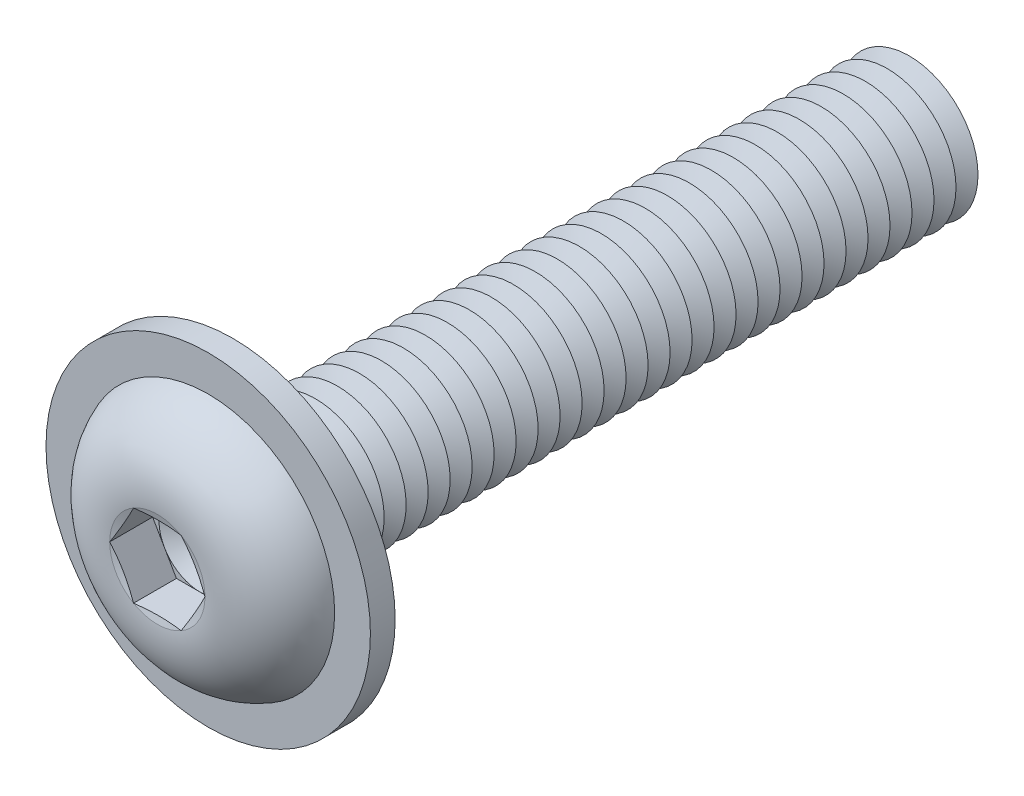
ISO-10303-21;
HEADER;
FILE_DESCRIPTION(('STEP AP214'),'2;1');
FILE_NAME('part.step','',(''),(''),'','','');
FILE_SCHEMA(('AUTOMOTIVE_DESIGN { 1 0 10303 214 1 1 1 1 }'));
ENDSEC;
DATA;
#1=APPLICATION_CONTEXT('core data for automotive mechanical design processes');
#2=APPLICATION_PROTOCOL_DEFINITION('international standard','automotive_design',2000,#1);
#3=PRODUCT_CONTEXT('',#1,'mechanical');
#4=PRODUCT('Part','Part','',(#3));
#5=PRODUCT_RELATED_PRODUCT_CATEGORY('part','',(#4));
#6=PRODUCT_DEFINITION_FORMATION('','',#4);
#7=PRODUCT_DEFINITION_CONTEXT('part definition',#1,'design');
#8=PRODUCT_DEFINITION('design','',#6,#7);
#9=PRODUCT_DEFINITION_SHAPE('','',#8);
#10=(LENGTH_UNIT() NAMED_UNIT(*) SI_UNIT(.MILLI.,.METRE.));
#11=(NAMED_UNIT(*) PLANE_ANGLE_UNIT() SI_UNIT($,.RADIAN.));
#12=(NAMED_UNIT(*) SI_UNIT($,.STERADIAN.) SOLID_ANGLE_UNIT());
#13=UNCERTAINTY_MEASURE_WITH_UNIT(LENGTH_MEASURE(1.E-05),#10,'distance_accuracy_value','');
#14=(GEOMETRIC_REPRESENTATION_CONTEXT(3) GLOBAL_UNCERTAINTY_ASSIGNED_CONTEXT((#13)) GLOBAL_UNIT_ASSIGNED_CONTEXT((#10,
#11,#12)) REPRESENTATION_CONTEXT('',''));
#15=CARTESIAN_POINT('',(0.,0.,0.));
#16=DIRECTION('',(0.,0.,1.));
#17=DIRECTION('',(1.,0.,0.));
#18=AXIS2_PLACEMENT_3D('',#15,#16,#17);
#19=CARTESIAN_POINT('',(0.,0.,-22.2));
#20=DIRECTION('',(0.,0.,1.));
#21=DIRECTION('',(1.,0.,0.));
#22=AXIS2_PLACEMENT_3D('',#19,#20,#21);
#23=CONICAL_SURFACE('',#22,2.50000000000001,1.0471975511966);
#24=CARTESIAN_POINT('',(0.,0.,-22.6));
#25=DIRECTION('',(0.,0.,1.));
#26=DIRECTION('',(1.,0.,0.));
#27=AXIS2_PLACEMENT_3D('',#24,#25,#26);
#28=CIRCLE('',#27,1.80717967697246);
#29=CARTESIAN_POINT('',(1.80717967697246,0.,-22.6));
#30=VERTEX_POINT('',#29);
#31=EDGE_CURVE('E458',#30,#30,#28,.T.);
#32=ORIENTED_EDGE('',*,*,#31,.T.);
#33=EDGE_LOOP('',(#32));
#34=FACE_BOUND('',#33,.T.);
#35=CARTESIAN_POINT('',(0.,0.,-22.2));
#36=DIRECTION('',(0.,0.,1.));
#37=DIRECTION('',(1.,0.,0.));
#38=AXIS2_PLACEMENT_3D('',#35,#36,#37);
#39=CIRCLE('',#38,2.50000000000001);
#40=CARTESIAN_POINT('',(2.50000000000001,0.,-22.2));
#41=VERTEX_POINT('',#40);
#42=EDGE_CURVE('E454',#41,#41,#39,.T.);
#43=ORIENTED_EDGE('',*,*,#42,.F.);
#44=EDGE_LOOP('',(#43));
#45=FACE_BOUND('',#44,.T.);
#46=ADVANCED_FACE('F39',(#34,#45),#23,.T.);
#47=CARTESIAN_POINT('',(0.,0.,-22.6));
#48=DIRECTION('',(0.,0.,-1.));
#49=DIRECTION('',(-1.,0.,0.));
#50=AXIS2_PLACEMENT_3D('',#47,#48,#49);
#51=CONICAL_SURFACE('',#50,1.80717967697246,1.0471975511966);
#52=CARTESIAN_POINT('',(0.,0.,-23.));
#53=DIRECTION('',(0.,0.,1.));
#54=DIRECTION('',(1.,0.,0.));
#55=AXIS2_PLACEMENT_3D('',#52,#53,#54);
#56=CIRCLE('',#55,2.50000000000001);
#57=CARTESIAN_POINT('',(2.50000000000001,0.,-23.));
#58=VERTEX_POINT('',#57);
#59=EDGE_CURVE('E462',#58,#58,#56,.T.);
#60=ORIENTED_EDGE('',*,*,#59,.T.);
#61=EDGE_LOOP('',(#60));
#62=FACE_BOUND('',#61,.T.);
#63=ORIENTED_EDGE('',*,*,#31,.F.);
#64=EDGE_LOOP('',(#63));
#65=FACE_BOUND('',#64,.T.);
#66=ADVANCED_FACE('F581',(#62,#65),#51,.T.);
#67=CARTESIAN_POINT('',(0.,2.50000000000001,-25.));
#68=DIRECTION('',(0.,0.,-1.));
#69=DIRECTION('',(-1.,0.,0.));
#70=AXIS2_PLACEMENT_3D('',#67,#68,#69);
#71=PLANE('',#70);
#72=CARTESIAN_POINT('',(0.,0.,-25.));
#73=DIRECTION('',(0.,0.,1.));
#74=DIRECTION('',(1.,0.,0.));
#75=AXIS2_PLACEMENT_3D('',#72,#73,#74);
#76=CIRCLE('',#75,1.80717967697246);
#77=CARTESIAN_POINT('',(1.80717967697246,0.,-25.));
#78=VERTEX_POINT('',#77);
#79=EDGE_CURVE('E482',#78,#78,#76,.T.);
#80=ORIENTED_EDGE('',*,*,#79,.F.);
#81=EDGE_LOOP('',(#80));
#82=FACE_BOUND('',#81,.T.);
#83=ADVANCED_FACE('F587',(#82),#71,.T.);
#84=CARTESIAN_POINT('',(0.,0.,-24.6));
#85=DIRECTION('',(0.,0.,1.));
#86=DIRECTION('',(1.,0.,0.));
#87=AXIS2_PLACEMENT_3D('',#84,#85,#86);
#88=CONICAL_SURFACE('',#87,2.50000000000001,1.0471975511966);
#89=ORIENTED_EDGE('',*,*,#79,.T.);
#90=EDGE_LOOP('',(#89));
#91=FACE_BOUND('',#90,.T.);
#92=CARTESIAN_POINT('',(0.,0.,-24.6));
#93=DIRECTION('',(0.,0.,1.));
#94=DIRECTION('',(1.,0.,0.));
#95=AXIS2_PLACEMENT_3D('',#92,#93,#94);
#96=CIRCLE('',#95,2.50000000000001);
#97=CARTESIAN_POINT('',(2.50000000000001,0.,-24.6));
#98=VERTEX_POINT('',#97);
#99=EDGE_CURVE('E478',#98,#98,#96,.T.);
#100=ORIENTED_EDGE('',*,*,#99,.F.);
#101=EDGE_LOOP('',(#100));
#102=FACE_BOUND('',#101,.T.);
#103=ADVANCED_FACE('F606',(#91,#102),#88,.T.);
#104=CARTESIAN_POINT('',(0.,0.,-24.2));
#105=DIRECTION('',(0.,0.,-1.));
#106=DIRECTION('',(-1.,0.,0.));
#107=AXIS2_PLACEMENT_3D('',#104,#105,#106);
#108=CONICAL_SURFACE('',#107,1.80717967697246,1.0471975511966);
#109=ORIENTED_EDGE('',*,*,#99,.T.);
#110=EDGE_LOOP('',(#109));
#111=FACE_BOUND('',#110,.T.);
#112=CARTESIAN_POINT('',(0.,0.,-24.2));
#113=DIRECTION('',(0.,0.,1.));
#114=DIRECTION('',(1.,0.,0.));
#115=AXIS2_PLACEMENT_3D('',#112,#113,#114);
#116=CIRCLE('',#115,1.80717967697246);
#117=CARTESIAN_POINT('',(1.80717967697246,0.,-24.2));
#118=VERTEX_POINT('',#117);
#119=EDGE_CURVE('E474',#118,#118,#116,.T.);
#120=ORIENTED_EDGE('',*,*,#119,.F.);
#121=EDGE_LOOP('',(#120));
#122=FACE_BOUND('',#121,.T.);
#123=ADVANCED_FACE('F603',(#111,#122),#108,.T.);
#124=CARTESIAN_POINT('',(0.,0.,-23.8));
#125=DIRECTION('',(0.,0.,1.));
#126=DIRECTION('',(1.,0.,0.));
#127=AXIS2_PLACEMENT_3D('',#124,#125,#126);
#128=CONICAL_SURFACE('',#127,2.50000000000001,1.0471975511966);
#129=ORIENTED_EDGE('',*,*,#119,.T.);
#130=EDGE_LOOP('',(#129));
#131=FACE_BOUND('',#130,.T.);
#132=CARTESIAN_POINT('',(0.,0.,-23.8));
#133=DIRECTION('',(0.,0.,1.));
#134=DIRECTION('',(1.,0.,0.));
#135=AXIS2_PLACEMENT_3D('',#132,#133,#134);
#136=CIRCLE('',#135,2.50000000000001);
#137=CARTESIAN_POINT('',(2.50000000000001,0.,-23.8));
#138=VERTEX_POINT('',#137);
#139=EDGE_CURVE('E470',#138,#138,#136,.T.);
#140=ORIENTED_EDGE('',*,*,#139,.F.);
#141=EDGE_LOOP('',(#140));
#142=FACE_BOUND('',#141,.T.);
#143=ADVANCED_FACE('F597',(#131,#142),#128,.T.);
#144=CARTESIAN_POINT('',(0.,0.,-23.4));
#145=DIRECTION('',(0.,0.,-1.));
#146=DIRECTION('',(-1.,0.,0.));
#147=AXIS2_PLACEMENT_3D('',#144,#145,#146);
#148=CONICAL_SURFACE('',#147,1.80717967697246,1.0471975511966);
#149=ORIENTED_EDGE('',*,*,#139,.T.);
#150=EDGE_LOOP('',(#149));
#151=FACE_BOUND('',#150,.T.);
#152=CARTESIAN_POINT('',(0.,0.,-23.4));
#153=DIRECTION('',(0.,0.,1.));
#154=DIRECTION('',(1.,0.,0.));
#155=AXIS2_PLACEMENT_3D('',#152,#153,#154);
#156=CIRCLE('',#155,1.80717967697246);
#157=CARTESIAN_POINT('',(1.80717967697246,0.,-23.4));
#158=VERTEX_POINT('',#157);
#159=EDGE_CURVE('E466',#158,#158,#156,.T.);
#160=ORIENTED_EDGE('',*,*,#159,.F.);
#161=EDGE_LOOP('',(#160));
#162=FACE_BOUND('',#161,.T.);
#163=ADVANCED_FACE('F593',(#151,#162),#148,.T.);
#164=CARTESIAN_POINT('',(0.,0.,-23.));
#165=DIRECTION('',(0.,0.,1.));
#166=DIRECTION('',(1.,0.,0.));
#167=AXIS2_PLACEMENT_3D('',#164,#165,#166);
#168=CONICAL_SURFACE('',#167,2.50000000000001,1.0471975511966);
#169=ORIENTED_EDGE('',*,*,#159,.T.);
#170=EDGE_LOOP('',(#169));
#171=FACE_BOUND('',#170,.T.);
#172=ORIENTED_EDGE('',*,*,#59,.F.);
#173=EDGE_LOOP('',(#172));
#174=FACE_BOUND('',#173,.T.);
#175=ADVANCED_FACE('F596',(#171,#174),#168,.T.);
#176=CARTESIAN_POINT('',(0.,0.,-21.4));
#177=DIRECTION('',(0.,0.,1.));
#178=DIRECTION('',(1.,0.,0.));
#179=AXIS2_PLACEMENT_3D('',#176,#177,#178);
#180=CONICAL_SURFACE('',#179,2.50000000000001,1.0471975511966);
#181=CARTESIAN_POINT('',(0.,0.,-21.8));
#182=DIRECTION('',(0.,0.,1.));
#183=DIRECTION('',(1.,0.,0.));
#184=AXIS2_PLACEMENT_3D('',#181,#182,#183);
#185=CIRCLE('',#184,1.80717967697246);
#186=CARTESIAN_POINT('',(1.80717967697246,0.,-21.8));
#187=VERTEX_POINT('',#186);
#188=EDGE_CURVE('E450',#187,#187,#185,.T.);
#189=ORIENTED_EDGE('',*,*,#188,.T.);
#190=EDGE_LOOP('',(#189));
#191=FACE_BOUND('',#190,.T.);
#192=CARTESIAN_POINT('',(0.,0.,-21.4));
#193=DIRECTION('',(0.,0.,1.));
#194=DIRECTION('',(1.,0.,0.));
#195=AXIS2_PLACEMENT_3D('',#192,#193,#194);
#196=CIRCLE('',#195,2.50000000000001);
#197=CARTESIAN_POINT('',(2.50000000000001,0.,-21.4));
#198=VERTEX_POINT('',#197);
#199=EDGE_CURVE('E446',#198,#198,#196,.T.);
#200=ORIENTED_EDGE('',*,*,#199,.F.);
#201=EDGE_LOOP('',(#200));
#202=FACE_BOUND('',#201,.T.);
#203=ADVANCED_FACE('F601',(#191,#202),#180,.T.);
#204=CARTESIAN_POINT('',(0.,0.,-21.8));
#205=DIRECTION('',(0.,0.,-1.));
#206=DIRECTION('',(-1.,0.,0.));
#207=AXIS2_PLACEMENT_3D('',#204,#205,#206);
#208=CONICAL_SURFACE('',#207,1.80717967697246,1.0471975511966);
#209=ORIENTED_EDGE('',*,*,#42,.T.);
#210=EDGE_LOOP('',(#209));
#211=FACE_BOUND('',#210,.T.);
#212=ORIENTED_EDGE('',*,*,#188,.F.);
#213=EDGE_LOOP('',(#212));
#214=FACE_BOUND('',#213,.T.);
#215=ADVANCED_FACE('F652',(#211,#214),#208,.T.);
#216=CARTESIAN_POINT('',(0.,0.,-20.6));
#217=DIRECTION('',(0.,0.,1.));
#218=DIRECTION('',(1.,0.,0.));
#219=AXIS2_PLACEMENT_3D('',#216,#217,#218);
#220=CONICAL_SURFACE('',#219,2.50000000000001,1.0471975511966);
#221=CARTESIAN_POINT('',(0.,0.,-21.));
#222=DIRECTION('',(0.,0.,1.));
#223=DIRECTION('',(1.,0.,0.));
#224=AXIS2_PLACEMENT_3D('',#221,#222,#223);
#225=CIRCLE('',#224,1.80717967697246);
#226=CARTESIAN_POINT('',(1.80717967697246,0.,-21.));
#227=VERTEX_POINT('',#226);
#228=EDGE_CURVE('E442',#227,#227,#225,.T.);
#229=ORIENTED_EDGE('',*,*,#228,.T.);
#230=EDGE_LOOP('',(#229));
#231=FACE_BOUND('',#230,.T.);
#232=CARTESIAN_POINT('',(0.,0.,-20.6));
#233=DIRECTION('',(0.,0.,1.));
#234=DIRECTION('',(1.,0.,0.));
#235=AXIS2_PLACEMENT_3D('',#232,#233,#234);
#236=CIRCLE('',#235,2.50000000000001);
#237=CARTESIAN_POINT('',(2.50000000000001,0.,-20.6));
#238=VERTEX_POINT('',#237);
#239=EDGE_CURVE('E438',#238,#238,#236,.T.);
#240=ORIENTED_EDGE('',*,*,#239,.F.);
#241=EDGE_LOOP('',(#240));
#242=FACE_BOUND('',#241,.T.);
#243=ADVANCED_FACE('F658',(#231,#242),#220,.T.);
#244=CARTESIAN_POINT('',(0.,0.,-21.));
#245=DIRECTION('',(0.,0.,-1.));
#246=DIRECTION('',(-1.,0.,0.));
#247=AXIS2_PLACEMENT_3D('',#244,#245,#246);
#248=CONICAL_SURFACE('',#247,1.80717967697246,1.0471975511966);
#249=ORIENTED_EDGE('',*,*,#199,.T.);
#250=EDGE_LOOP('',(#249));
#251=FACE_BOUND('',#250,.T.);
#252=ORIENTED_EDGE('',*,*,#228,.F.);
#253=EDGE_LOOP('',(#252));
#254=FACE_BOUND('',#253,.T.);
#255=ADVANCED_FACE('F665',(#251,#254),#248,.T.);
#256=CARTESIAN_POINT('',(0.,0.,-19.8));
#257=DIRECTION('',(0.,0.,1.));
#258=DIRECTION('',(1.,0.,0.));
#259=AXIS2_PLACEMENT_3D('',#256,#257,#258);
#260=CONICAL_SURFACE('',#259,2.50000000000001,1.0471975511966);
#261=CARTESIAN_POINT('',(0.,0.,-20.2));
#262=DIRECTION('',(0.,0.,1.));
#263=DIRECTION('',(1.,0.,0.));
#264=AXIS2_PLACEMENT_3D('',#261,#262,#263);
#265=CIRCLE('',#264,1.80717967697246);
#266=CARTESIAN_POINT('',(1.80717967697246,0.,-20.2));
#267=VERTEX_POINT('',#266);
#268=EDGE_CURVE('E434',#267,#267,#265,.T.);
#269=ORIENTED_EDGE('',*,*,#268,.T.);
#270=EDGE_LOOP('',(#269));
#271=FACE_BOUND('',#270,.T.);
#272=CARTESIAN_POINT('',(0.,0.,-19.8));
#273=DIRECTION('',(0.,0.,1.));
#274=DIRECTION('',(1.,0.,0.));
#275=AXIS2_PLACEMENT_3D('',#272,#273,#274);
#276=CIRCLE('',#275,2.50000000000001);
#277=CARTESIAN_POINT('',(2.50000000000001,0.,-19.8));
#278=VERTEX_POINT('',#277);
#279=EDGE_CURVE('E430',#278,#278,#276,.T.);
#280=ORIENTED_EDGE('',*,*,#279,.F.);
#281=EDGE_LOOP('',(#280));
#282=FACE_BOUND('',#281,.T.);
#283=ADVANCED_FACE('F672',(#271,#282),#260,.T.);
#284=CARTESIAN_POINT('',(0.,0.,-20.2));
#285=DIRECTION('',(0.,0.,-1.));
#286=DIRECTION('',(-1.,0.,0.));
#287=AXIS2_PLACEMENT_3D('',#284,#285,#286);
#288=CONICAL_SURFACE('',#287,1.80717967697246,1.0471975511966);
#289=ORIENTED_EDGE('',*,*,#239,.T.);
#290=EDGE_LOOP('',(#289));
#291=FACE_BOUND('',#290,.T.);
#292=ORIENTED_EDGE('',*,*,#268,.F.);
#293=EDGE_LOOP('',(#292));
#294=FACE_BOUND('',#293,.T.);
#295=ADVANCED_FACE('F679',(#291,#294),#288,.T.);
#296=CARTESIAN_POINT('',(0.,0.,-19.));
#297=DIRECTION('',(0.,0.,1.));
#298=DIRECTION('',(1.,0.,0.));
#299=AXIS2_PLACEMENT_3D('',#296,#297,#298);
#300=CONICAL_SURFACE('',#299,2.50000000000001,1.0471975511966);
#301=CARTESIAN_POINT('',(0.,0.,-19.4));
#302=DIRECTION('',(0.,0.,1.));
#303=DIRECTION('',(1.,0.,0.));
#304=AXIS2_PLACEMENT_3D('',#301,#302,#303);
#305=CIRCLE('',#304,1.80717967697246);
#306=CARTESIAN_POINT('',(1.80717967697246,0.,-19.4));
#307=VERTEX_POINT('',#306);
#308=EDGE_CURVE('E426',#307,#307,#305,.T.);
#309=ORIENTED_EDGE('',*,*,#308,.T.);
#310=EDGE_LOOP('',(#309));
#311=FACE_BOUND('',#310,.T.);
#312=CARTESIAN_POINT('',(0.,0.,-19.));
#313=DIRECTION('',(0.,0.,1.));
#314=DIRECTION('',(1.,0.,0.));
#315=AXIS2_PLACEMENT_3D('',#312,#313,#314);
#316=CIRCLE('',#315,2.50000000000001);
#317=CARTESIAN_POINT('',(2.50000000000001,0.,-19.));
#318=VERTEX_POINT('',#317);
#319=EDGE_CURVE('E422',#318,#318,#316,.T.);
#320=ORIENTED_EDGE('',*,*,#319,.F.);
#321=EDGE_LOOP('',(#320));
#322=FACE_BOUND('',#321,.T.);
#323=ADVANCED_FACE('F686',(#311,#322),#300,.T.);
#324=CARTESIAN_POINT('',(0.,0.,-19.4));
#325=DIRECTION('',(0.,0.,-1.));
#326=DIRECTION('',(-1.,0.,0.));
#327=AXIS2_PLACEMENT_3D('',#324,#325,#326);
#328=CONICAL_SURFACE('',#327,1.80717967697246,1.0471975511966);
#329=ORIENTED_EDGE('',*,*,#279,.T.);
#330=EDGE_LOOP('',(#329));
#331=FACE_BOUND('',#330,.T.);
#332=ORIENTED_EDGE('',*,*,#308,.F.);
#333=EDGE_LOOP('',(#332));
#334=FACE_BOUND('',#333,.T.);
#335=ADVANCED_FACE('F693',(#331,#334),#328,.T.);
#336=CARTESIAN_POINT('',(0.,0.,-18.2));
#337=DIRECTION('',(0.,0.,1.));
#338=DIRECTION('',(1.,0.,0.));
#339=AXIS2_PLACEMENT_3D('',#336,#337,#338);
#340=CONICAL_SURFACE('',#339,2.50000000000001,1.0471975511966);
#341=CARTESIAN_POINT('',(0.,0.,-18.6));
#342=DIRECTION('',(0.,0.,1.));
#343=DIRECTION('',(1.,0.,0.));
#344=AXIS2_PLACEMENT_3D('',#341,#342,#343);
#345=CIRCLE('',#344,1.80717967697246);
#346=CARTESIAN_POINT('',(1.80717967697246,0.,-18.6));
#347=VERTEX_POINT('',#346);
#348=EDGE_CURVE('E418',#347,#347,#345,.T.);
#349=ORIENTED_EDGE('',*,*,#348,.T.);
#350=EDGE_LOOP('',(#349));
#351=FACE_BOUND('',#350,.T.);
#352=CARTESIAN_POINT('',(0.,0.,-18.2));
#353=DIRECTION('',(0.,0.,1.));
#354=DIRECTION('',(1.,0.,0.));
#355=AXIS2_PLACEMENT_3D('',#352,#353,#354);
#356=CIRCLE('',#355,2.50000000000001);
#357=CARTESIAN_POINT('',(2.50000000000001,0.,-18.2));
#358=VERTEX_POINT('',#357);
#359=EDGE_CURVE('E414',#358,#358,#356,.T.);
#360=ORIENTED_EDGE('',*,*,#359,.F.);
#361=EDGE_LOOP('',(#360));
#362=FACE_BOUND('',#361,.T.);
#363=ADVANCED_FACE('F700',(#351,#362),#340,.T.);
#364=CARTESIAN_POINT('',(0.,0.,-18.6));
#365=DIRECTION('',(0.,0.,-1.));
#366=DIRECTION('',(-1.,0.,0.));
#367=AXIS2_PLACEMENT_3D('',#364,#365,#366);
#368=CONICAL_SURFACE('',#367,1.80717967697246,1.0471975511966);
#369=ORIENTED_EDGE('',*,*,#319,.T.);
#370=EDGE_LOOP('',(#369));
#371=FACE_BOUND('',#370,.T.);
#372=ORIENTED_EDGE('',*,*,#348,.F.);
#373=EDGE_LOOP('',(#372));
#374=FACE_BOUND('',#373,.T.);
#375=ADVANCED_FACE('F707',(#371,#374),#368,.T.);
#376=CARTESIAN_POINT('',(0.,0.,-17.4));
#377=DIRECTION('',(0.,0.,1.));
#378=DIRECTION('',(1.,0.,0.));
#379=AXIS2_PLACEMENT_3D('',#376,#377,#378);
#380=CONICAL_SURFACE('',#379,2.50000000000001,1.0471975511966);
#381=CARTESIAN_POINT('',(0.,0.,-17.8));
#382=DIRECTION('',(0.,0.,1.));
#383=DIRECTION('',(1.,0.,0.));
#384=AXIS2_PLACEMENT_3D('',#381,#382,#383);
#385=CIRCLE('',#384,1.80717967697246);
#386=CARTESIAN_POINT('',(1.80717967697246,0.,-17.8));
#387=VERTEX_POINT('',#386);
#388=EDGE_CURVE('E410',#387,#387,#385,.T.);
#389=ORIENTED_EDGE('',*,*,#388,.T.);
#390=EDGE_LOOP('',(#389));
#391=FACE_BOUND('',#390,.T.);
#392=CARTESIAN_POINT('',(0.,0.,-17.4));
#393=DIRECTION('',(0.,0.,1.));
#394=DIRECTION('',(1.,0.,0.));
#395=AXIS2_PLACEMENT_3D('',#392,#393,#394);
#396=CIRCLE('',#395,2.50000000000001);
#397=CARTESIAN_POINT('',(2.50000000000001,0.,-17.4));
#398=VERTEX_POINT('',#397);
#399=EDGE_CURVE('E406',#398,#398,#396,.T.);
#400=ORIENTED_EDGE('',*,*,#399,.F.);
#401=EDGE_LOOP('',(#400));
#402=FACE_BOUND('',#401,.T.);
#403=ADVANCED_FACE('F714',(#391,#402),#380,.T.);
#404=CARTESIAN_POINT('',(0.,0.,-17.8));
#405=DIRECTION('',(0.,0.,-1.));
#406=DIRECTION('',(-1.,0.,0.));
#407=AXIS2_PLACEMENT_3D('',#404,#405,#406);
#408=CONICAL_SURFACE('',#407,1.80717967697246,1.0471975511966);
#409=ORIENTED_EDGE('',*,*,#359,.T.);
#410=EDGE_LOOP('',(#409));
#411=FACE_BOUND('',#410,.T.);
#412=ORIENTED_EDGE('',*,*,#388,.F.);
#413=EDGE_LOOP('',(#412));
#414=FACE_BOUND('',#413,.T.);
#415=ADVANCED_FACE('F721',(#411,#414),#408,.T.);
#416=CARTESIAN_POINT('',(0.,0.,-16.6));
#417=DIRECTION('',(0.,0.,1.));
#418=DIRECTION('',(1.,0.,0.));
#419=AXIS2_PLACEMENT_3D('',#416,#417,#418);
#420=CONICAL_SURFACE('',#419,2.50000000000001,1.0471975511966);
#421=CARTESIAN_POINT('',(0.,0.,-17.));
#422=DIRECTION('',(0.,0.,1.));
#423=DIRECTION('',(1.,0.,0.));
#424=AXIS2_PLACEMENT_3D('',#421,#422,#423);
#425=CIRCLE('',#424,1.80717967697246);
#426=CARTESIAN_POINT('',(1.80717967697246,0.,-17.));
#427=VERTEX_POINT('',#426);
#428=EDGE_CURVE('E402',#427,#427,#425,.T.);
#429=ORIENTED_EDGE('',*,*,#428,.T.);
#430=EDGE_LOOP('',(#429));
#431=FACE_BOUND('',#430,.T.);
#432=CARTESIAN_POINT('',(0.,0.,-16.6));
#433=DIRECTION('',(0.,0.,1.));
#434=DIRECTION('',(1.,0.,0.));
#435=AXIS2_PLACEMENT_3D('',#432,#433,#434);
#436=CIRCLE('',#435,2.50000000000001);
#437=CARTESIAN_POINT('',(2.50000000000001,0.,-16.6));
#438=VERTEX_POINT('',#437);
#439=EDGE_CURVE('E398',#438,#438,#436,.T.);
#440=ORIENTED_EDGE('',*,*,#439,.F.);
#441=EDGE_LOOP('',(#440));
#442=FACE_BOUND('',#441,.T.);
#443=ADVANCED_FACE('F728',(#431,#442),#420,.T.);
#444=CARTESIAN_POINT('',(0.,0.,-17.));
#445=DIRECTION('',(0.,0.,-1.));
#446=DIRECTION('',(-1.,0.,0.));
#447=AXIS2_PLACEMENT_3D('',#444,#445,#446);
#448=CONICAL_SURFACE('',#447,1.80717967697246,1.0471975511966);
#449=ORIENTED_EDGE('',*,*,#399,.T.);
#450=EDGE_LOOP('',(#449));
#451=FACE_BOUND('',#450,.T.);
#452=ORIENTED_EDGE('',*,*,#428,.F.);
#453=EDGE_LOOP('',(#452));
#454=FACE_BOUND('',#453,.T.);
#455=ADVANCED_FACE('F735',(#451,#454),#448,.T.);
#456=CARTESIAN_POINT('',(0.,0.,-15.8));
#457=DIRECTION('',(0.,0.,1.));
#458=DIRECTION('',(1.,0.,0.));
#459=AXIS2_PLACEMENT_3D('',#456,#457,#458);
#460=CONICAL_SURFACE('',#459,2.50000000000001,1.0471975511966);
#461=CARTESIAN_POINT('',(0.,0.,-16.2));
#462=DIRECTION('',(0.,0.,1.));
#463=DIRECTION('',(1.,0.,0.));
#464=AXIS2_PLACEMENT_3D('',#461,#462,#463);
#465=CIRCLE('',#464,1.80717967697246);
#466=CARTESIAN_POINT('',(1.80717967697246,0.,-16.2));
#467=VERTEX_POINT('',#466);
#468=EDGE_CURVE('E394',#467,#467,#465,.T.);
#469=ORIENTED_EDGE('',*,*,#468,.T.);
#470=EDGE_LOOP('',(#469));
#471=FACE_BOUND('',#470,.T.);
#472=CARTESIAN_POINT('',(0.,0.,-15.8));
#473=DIRECTION('',(0.,0.,1.));
#474=DIRECTION('',(1.,0.,0.));
#475=AXIS2_PLACEMENT_3D('',#472,#473,#474);
#476=CIRCLE('',#475,2.50000000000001);
#477=CARTESIAN_POINT('',(2.50000000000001,0.,-15.8));
#478=VERTEX_POINT('',#477);
#479=EDGE_CURVE('E390',#478,#478,#476,.T.);
#480=ORIENTED_EDGE('',*,*,#479,.F.);
#481=EDGE_LOOP('',(#480));
#482=FACE_BOUND('',#481,.T.);
#483=ADVANCED_FACE('F742',(#471,#482),#460,.T.);
#484=CARTESIAN_POINT('',(0.,0.,-16.2));
#485=DIRECTION('',(0.,0.,-1.));
#486=DIRECTION('',(-1.,0.,0.));
#487=AXIS2_PLACEMENT_3D('',#484,#485,#486);
#488=CONICAL_SURFACE('',#487,1.80717967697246,1.0471975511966);
#489=ORIENTED_EDGE('',*,*,#439,.T.);
#490=EDGE_LOOP('',(#489));
#491=FACE_BOUND('',#490,.T.);
#492=ORIENTED_EDGE('',*,*,#468,.F.);
#493=EDGE_LOOP('',(#492));
#494=FACE_BOUND('',#493,.T.);
#495=ADVANCED_FACE('F749',(#491,#494),#488,.T.);
#496=CARTESIAN_POINT('',(0.,0.,-15.));
#497=DIRECTION('',(0.,0.,1.));
#498=DIRECTION('',(1.,0.,0.));
#499=AXIS2_PLACEMENT_3D('',#496,#497,#498);
#500=CONICAL_SURFACE('',#499,2.50000000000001,1.0471975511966);
#501=CARTESIAN_POINT('',(0.,0.,-15.4));
#502=DIRECTION('',(0.,0.,1.));
#503=DIRECTION('',(1.,0.,0.));
#504=AXIS2_PLACEMENT_3D('',#501,#502,#503);
#505=CIRCLE('',#504,1.80717967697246);
#506=CARTESIAN_POINT('',(1.80717967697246,0.,-15.4));
#507=VERTEX_POINT('',#506);
#508=EDGE_CURVE('E386',#507,#507,#505,.T.);
#509=ORIENTED_EDGE('',*,*,#508,.T.);
#510=EDGE_LOOP('',(#509));
#511=FACE_BOUND('',#510,.T.);
#512=CARTESIAN_POINT('',(0.,0.,-15.));
#513=DIRECTION('',(0.,0.,1.));
#514=DIRECTION('',(1.,0.,0.));
#515=AXIS2_PLACEMENT_3D('',#512,#513,#514);
#516=CIRCLE('',#515,2.50000000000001);
#517=CARTESIAN_POINT('',(2.50000000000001,0.,-15.));
#518=VERTEX_POINT('',#517);
#519=EDGE_CURVE('E382',#518,#518,#516,.T.);
#520=ORIENTED_EDGE('',*,*,#519,.F.);
#521=EDGE_LOOP('',(#520));
#522=FACE_BOUND('',#521,.T.);
#523=ADVANCED_FACE('F756',(#511,#522),#500,.T.);
#524=CARTESIAN_POINT('',(0.,0.,-15.4));
#525=DIRECTION('',(0.,0.,-1.));
#526=DIRECTION('',(-1.,0.,0.));
#527=AXIS2_PLACEMENT_3D('',#524,#525,#526);
#528=CONICAL_SURFACE('',#527,1.80717967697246,1.0471975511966);
#529=ORIENTED_EDGE('',*,*,#479,.T.);
#530=EDGE_LOOP('',(#529));
#531=FACE_BOUND('',#530,.T.);
#532=ORIENTED_EDGE('',*,*,#508,.F.);
#533=EDGE_LOOP('',(#532));
#534=FACE_BOUND('',#533,.T.);
#535=ADVANCED_FACE('F763',(#531,#534),#528,.T.);
#536=CARTESIAN_POINT('',(0.,0.,-14.2));
#537=DIRECTION('',(0.,0.,1.));
#538=DIRECTION('',(1.,0.,0.));
#539=AXIS2_PLACEMENT_3D('',#536,#537,#538);
#540=CONICAL_SURFACE('',#539,2.50000000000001,1.0471975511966);
#541=CARTESIAN_POINT('',(0.,0.,-14.6));
#542=DIRECTION('',(0.,0.,1.));
#543=DIRECTION('',(1.,0.,0.));
#544=AXIS2_PLACEMENT_3D('',#541,#542,#543);
#545=CIRCLE('',#544,1.80717967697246);
#546=CARTESIAN_POINT('',(1.80717967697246,0.,-14.6));
#547=VERTEX_POINT('',#546);
#548=EDGE_CURVE('E378',#547,#547,#545,.T.);
#549=ORIENTED_EDGE('',*,*,#548,.T.);
#550=EDGE_LOOP('',(#549));
#551=FACE_BOUND('',#550,.T.);
#552=CARTESIAN_POINT('',(0.,0.,-14.2));
#553=DIRECTION('',(0.,0.,1.));
#554=DIRECTION('',(1.,0.,0.));
#555=AXIS2_PLACEMENT_3D('',#552,#553,#554);
#556=CIRCLE('',#555,2.50000000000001);
#557=CARTESIAN_POINT('',(2.50000000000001,0.,-14.2));
#558=VERTEX_POINT('',#557);
#559=EDGE_CURVE('E374',#558,#558,#556,.T.);
#560=ORIENTED_EDGE('',*,*,#559,.F.);
#561=EDGE_LOOP('',(#560));
#562=FACE_BOUND('',#561,.T.);
#563=ADVANCED_FACE('F770',(#551,#562),#540,.T.);
#564=CARTESIAN_POINT('',(0.,0.,-14.6));
#565=DIRECTION('',(0.,0.,-1.));
#566=DIRECTION('',(-1.,0.,0.));
#567=AXIS2_PLACEMENT_3D('',#564,#565,#566);
#568=CONICAL_SURFACE('',#567,1.80717967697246,1.0471975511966);
#569=ORIENTED_EDGE('',*,*,#519,.T.);
#570=EDGE_LOOP('',(#569));
#571=FACE_BOUND('',#570,.T.);
#572=ORIENTED_EDGE('',*,*,#548,.F.);
#573=EDGE_LOOP('',(#572));
#574=FACE_BOUND('',#573,.T.);
#575=ADVANCED_FACE('F777',(#571,#574),#568,.T.);
#576=CARTESIAN_POINT('',(0.,0.,-13.4));
#577=DIRECTION('',(0.,0.,1.));
#578=DIRECTION('',(1.,0.,0.));
#579=AXIS2_PLACEMENT_3D('',#576,#577,#578);
#580=CONICAL_SURFACE('',#579,2.50000000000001,1.0471975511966);
#581=CARTESIAN_POINT('',(0.,0.,-13.8));
#582=DIRECTION('',(0.,0.,1.));
#583=DIRECTION('',(1.,0.,0.));
#584=AXIS2_PLACEMENT_3D('',#581,#582,#583);
#585=CIRCLE('',#584,1.80717967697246);
#586=CARTESIAN_POINT('',(1.80717967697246,0.,-13.8));
#587=VERTEX_POINT('',#586);
#588=EDGE_CURVE('E370',#587,#587,#585,.T.);
#589=ORIENTED_EDGE('',*,*,#588,.T.);
#590=EDGE_LOOP('',(#589));
#591=FACE_BOUND('',#590,.T.);
#592=CARTESIAN_POINT('',(0.,0.,-13.4));
#593=DIRECTION('',(0.,0.,1.));
#594=DIRECTION('',(1.,0.,0.));
#595=AXIS2_PLACEMENT_3D('',#592,#593,#594);
#596=CIRCLE('',#595,2.50000000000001);
#597=CARTESIAN_POINT('',(2.50000000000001,0.,-13.4));
#598=VERTEX_POINT('',#597);
#599=EDGE_CURVE('E366',#598,#598,#596,.T.);
#600=ORIENTED_EDGE('',*,*,#599,.F.);
#601=EDGE_LOOP('',(#600));
#602=FACE_BOUND('',#601,.T.);
#603=ADVANCED_FACE('F784',(#591,#602),#580,.T.);
#604=CARTESIAN_POINT('',(0.,0.,-13.8));
#605=DIRECTION('',(0.,0.,-1.));
#606=DIRECTION('',(-1.,0.,0.));
#607=AXIS2_PLACEMENT_3D('',#604,#605,#606);
#608=CONICAL_SURFACE('',#607,1.80717967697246,1.0471975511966);
#609=ORIENTED_EDGE('',*,*,#559,.T.);
#610=EDGE_LOOP('',(#609));
#611=FACE_BOUND('',#610,.T.);
#612=ORIENTED_EDGE('',*,*,#588,.F.);
#613=EDGE_LOOP('',(#612));
#614=FACE_BOUND('',#613,.T.);
#615=ADVANCED_FACE('F791',(#611,#614),#608,.T.);
#616=CARTESIAN_POINT('',(0.,0.,-12.6));
#617=DIRECTION('',(0.,0.,1.));
#618=DIRECTION('',(1.,0.,0.));
#619=AXIS2_PLACEMENT_3D('',#616,#617,#618);
#620=CONICAL_SURFACE('',#619,2.50000000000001,1.0471975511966);
#621=CARTESIAN_POINT('',(0.,0.,-13.));
#622=DIRECTION('',(0.,0.,1.));
#623=DIRECTION('',(1.,0.,0.));
#624=AXIS2_PLACEMENT_3D('',#621,#622,#623);
#625=CIRCLE('',#624,1.80717967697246);
#626=CARTESIAN_POINT('',(1.80717967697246,0.,-13.));
#627=VERTEX_POINT('',#626);
#628=EDGE_CURVE('E362',#627,#627,#625,.T.);
#629=ORIENTED_EDGE('',*,*,#628,.T.);
#630=EDGE_LOOP('',(#629));
#631=FACE_BOUND('',#630,.T.);
#632=CARTESIAN_POINT('',(0.,0.,-12.6));
#633=DIRECTION('',(0.,0.,1.));
#634=DIRECTION('',(1.,0.,0.));
#635=AXIS2_PLACEMENT_3D('',#632,#633,#634);
#636=CIRCLE('',#635,2.50000000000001);
#637=CARTESIAN_POINT('',(2.50000000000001,0.,-12.6));
#638=VERTEX_POINT('',#637);
#639=EDGE_CURVE('E358',#638,#638,#636,.T.);
#640=ORIENTED_EDGE('',*,*,#639,.F.);
#641=EDGE_LOOP('',(#640));
#642=FACE_BOUND('',#641,.T.);
#643=ADVANCED_FACE('F798',(#631,#642),#620,.T.);
#644=CARTESIAN_POINT('',(0.,0.,-13.));
#645=DIRECTION('',(0.,0.,-1.));
#646=DIRECTION('',(-1.,0.,0.));
#647=AXIS2_PLACEMENT_3D('',#644,#645,#646);
#648=CONICAL_SURFACE('',#647,1.80717967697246,1.0471975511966);
#649=ORIENTED_EDGE('',*,*,#599,.T.);
#650=EDGE_LOOP('',(#649));
#651=FACE_BOUND('',#650,.T.);
#652=ORIENTED_EDGE('',*,*,#628,.F.);
#653=EDGE_LOOP('',(#652));
#654=FACE_BOUND('',#653,.T.);
#655=ADVANCED_FACE('F805',(#651,#654),#648,.T.);
#656=CARTESIAN_POINT('',(0.,0.,-11.8));
#657=DIRECTION('',(0.,0.,1.));
#658=DIRECTION('',(1.,0.,0.));
#659=AXIS2_PLACEMENT_3D('',#656,#657,#658);
#660=CONICAL_SURFACE('',#659,2.50000000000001,1.0471975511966);
#661=CARTESIAN_POINT('',(0.,0.,-12.2));
#662=DIRECTION('',(0.,0.,1.));
#663=DIRECTION('',(1.,0.,0.));
#664=AXIS2_PLACEMENT_3D('',#661,#662,#663);
#665=CIRCLE('',#664,1.80717967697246);
#666=CARTESIAN_POINT('',(1.80717967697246,0.,-12.2));
#667=VERTEX_POINT('',#666);
#668=EDGE_CURVE('E354',#667,#667,#665,.T.);
#669=ORIENTED_EDGE('',*,*,#668,.T.);
#670=EDGE_LOOP('',(#669));
#671=FACE_BOUND('',#670,.T.);
#672=CARTESIAN_POINT('',(0.,0.,-11.8));
#673=DIRECTION('',(0.,0.,1.));
#674=DIRECTION('',(1.,0.,0.));
#675=AXIS2_PLACEMENT_3D('',#672,#673,#674);
#676=CIRCLE('',#675,2.50000000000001);
#677=CARTESIAN_POINT('',(2.50000000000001,0.,-11.8));
#678=VERTEX_POINT('',#677);
#679=EDGE_CURVE('E350',#678,#678,#676,.T.);
#680=ORIENTED_EDGE('',*,*,#679,.F.);
#681=EDGE_LOOP('',(#680));
#682=FACE_BOUND('',#681,.T.);
#683=ADVANCED_FACE('F812',(#671,#682),#660,.T.);
#684=CARTESIAN_POINT('',(0.,0.,-12.2));
#685=DIRECTION('',(0.,0.,-1.));
#686=DIRECTION('',(-1.,0.,0.));
#687=AXIS2_PLACEMENT_3D('',#684,#685,#686);
#688=CONICAL_SURFACE('',#687,1.80717967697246,1.0471975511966);
#689=ORIENTED_EDGE('',*,*,#639,.T.);
#690=EDGE_LOOP('',(#689));
#691=FACE_BOUND('',#690,.T.);
#692=ORIENTED_EDGE('',*,*,#668,.F.);
#693=EDGE_LOOP('',(#692));
#694=FACE_BOUND('',#693,.T.);
#695=ADVANCED_FACE('F819',(#691,#694),#688,.T.);
#696=CARTESIAN_POINT('',(0.,0.,-11.));
#697=DIRECTION('',(0.,0.,1.));
#698=DIRECTION('',(1.,0.,0.));
#699=AXIS2_PLACEMENT_3D('',#696,#697,#698);
#700=CONICAL_SURFACE('',#699,2.50000000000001,1.0471975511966);
#701=CARTESIAN_POINT('',(0.,0.,-11.4));
#702=DIRECTION('',(0.,0.,1.));
#703=DIRECTION('',(1.,0.,0.));
#704=AXIS2_PLACEMENT_3D('',#701,#702,#703);
#705=CIRCLE('',#704,1.80717967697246);
#706=CARTESIAN_POINT('',(1.80717967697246,0.,-11.4));
#707=VERTEX_POINT('',#706);
#708=EDGE_CURVE('E346',#707,#707,#705,.T.);
#709=ORIENTED_EDGE('',*,*,#708,.T.);
#710=EDGE_LOOP('',(#709));
#711=FACE_BOUND('',#710,.T.);
#712=CARTESIAN_POINT('',(0.,0.,-11.));
#713=DIRECTION('',(0.,0.,1.));
#714=DIRECTION('',(1.,0.,0.));
#715=AXIS2_PLACEMENT_3D('',#712,#713,#714);
#716=CIRCLE('',#715,2.50000000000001);
#717=CARTESIAN_POINT('',(2.50000000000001,0.,-11.));
#718=VERTEX_POINT('',#717);
#719=EDGE_CURVE('E342',#718,#718,#716,.T.);
#720=ORIENTED_EDGE('',*,*,#719,.F.);
#721=EDGE_LOOP('',(#720));
#722=FACE_BOUND('',#721,.T.);
#723=ADVANCED_FACE('F826',(#711,#722),#700,.T.);
#724=CARTESIAN_POINT('',(0.,0.,-11.4));
#725=DIRECTION('',(0.,0.,-1.));
#726=DIRECTION('',(-1.,0.,0.));
#727=AXIS2_PLACEMENT_3D('',#724,#725,#726);
#728=CONICAL_SURFACE('',#727,1.80717967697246,1.0471975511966);
#729=ORIENTED_EDGE('',*,*,#679,.T.);
#730=EDGE_LOOP('',(#729));
#731=FACE_BOUND('',#730,.T.);
#732=ORIENTED_EDGE('',*,*,#708,.F.);
#733=EDGE_LOOP('',(#732));
#734=FACE_BOUND('',#733,.T.);
#735=ADVANCED_FACE('F833',(#731,#734),#728,.T.);
#736=CARTESIAN_POINT('',(0.,0.,-10.2));
#737=DIRECTION('',(0.,0.,1.));
#738=DIRECTION('',(1.,0.,0.));
#739=AXIS2_PLACEMENT_3D('',#736,#737,#738);
#740=CONICAL_SURFACE('',#739,2.50000000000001,1.0471975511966);
#741=CARTESIAN_POINT('',(0.,0.,-10.6));
#742=DIRECTION('',(0.,0.,1.));
#743=DIRECTION('',(1.,0.,0.));
#744=AXIS2_PLACEMENT_3D('',#741,#742,#743);
#745=CIRCLE('',#744,1.80717967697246);
#746=CARTESIAN_POINT('',(1.80717967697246,0.,-10.6));
#747=VERTEX_POINT('',#746);
#748=EDGE_CURVE('E338',#747,#747,#745,.T.);
#749=ORIENTED_EDGE('',*,*,#748,.T.);
#750=EDGE_LOOP('',(#749));
#751=FACE_BOUND('',#750,.T.);
#752=CARTESIAN_POINT('',(0.,0.,-10.2));
#753=DIRECTION('',(0.,0.,1.));
#754=DIRECTION('',(1.,0.,0.));
#755=AXIS2_PLACEMENT_3D('',#752,#753,#754);
#756=CIRCLE('',#755,2.50000000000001);
#757=CARTESIAN_POINT('',(2.50000000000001,0.,-10.2));
#758=VERTEX_POINT('',#757);
#759=EDGE_CURVE('E334',#758,#758,#756,.T.);
#760=ORIENTED_EDGE('',*,*,#759,.F.);
#761=EDGE_LOOP('',(#760));
#762=FACE_BOUND('',#761,.T.);
#763=ADVANCED_FACE('F840',(#751,#762),#740,.T.);
#764=CARTESIAN_POINT('',(0.,0.,-10.6));
#765=DIRECTION('',(0.,0.,-1.));
#766=DIRECTION('',(-1.,0.,0.));
#767=AXIS2_PLACEMENT_3D('',#764,#765,#766);
#768=CONICAL_SURFACE('',#767,1.80717967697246,1.0471975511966);
#769=ORIENTED_EDGE('',*,*,#719,.T.);
#770=EDGE_LOOP('',(#769));
#771=FACE_BOUND('',#770,.T.);
#772=ORIENTED_EDGE('',*,*,#748,.F.);
#773=EDGE_LOOP('',(#772));
#774=FACE_BOUND('',#773,.T.);
#775=ADVANCED_FACE('F847',(#771,#774),#768,.T.);
#776=CARTESIAN_POINT('',(0.,0.,-9.4));
#777=DIRECTION('',(0.,0.,1.));
#778=DIRECTION('',(1.,0.,0.));
#779=AXIS2_PLACEMENT_3D('',#776,#777,#778);
#780=CONICAL_SURFACE('',#779,2.50000000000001,1.0471975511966);
#781=CARTESIAN_POINT('',(0.,0.,-9.8));
#782=DIRECTION('',(0.,0.,1.));
#783=DIRECTION('',(1.,0.,0.));
#784=AXIS2_PLACEMENT_3D('',#781,#782,#783);
#785=CIRCLE('',#784,1.80717967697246);
#786=CARTESIAN_POINT('',(1.80717967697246,0.,-9.8));
#787=VERTEX_POINT('',#786);
#788=EDGE_CURVE('E330',#787,#787,#785,.T.);
#789=ORIENTED_EDGE('',*,*,#788,.T.);
#790=EDGE_LOOP('',(#789));
#791=FACE_BOUND('',#790,.T.);
#792=CARTESIAN_POINT('',(0.,0.,-9.4));
#793=DIRECTION('',(0.,0.,1.));
#794=DIRECTION('',(1.,0.,0.));
#795=AXIS2_PLACEMENT_3D('',#792,#793,#794);
#796=CIRCLE('',#795,2.50000000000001);
#797=CARTESIAN_POINT('',(2.50000000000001,0.,-9.4));
#798=VERTEX_POINT('',#797);
#799=EDGE_CURVE('E326',#798,#798,#796,.T.);
#800=ORIENTED_EDGE('',*,*,#799,.F.);
#801=EDGE_LOOP('',(#800));
#802=FACE_BOUND('',#801,.T.);
#803=ADVANCED_FACE('F854',(#791,#802),#780,.T.);
#804=CARTESIAN_POINT('',(0.,0.,-9.8));
#805=DIRECTION('',(0.,0.,-1.));
#806=DIRECTION('',(-1.,0.,0.));
#807=AXIS2_PLACEMENT_3D('',#804,#805,#806);
#808=CONICAL_SURFACE('',#807,1.80717967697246,1.0471975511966);
#809=ORIENTED_EDGE('',*,*,#759,.T.);
#810=EDGE_LOOP('',(#809));
#811=FACE_BOUND('',#810,.T.);
#812=ORIENTED_EDGE('',*,*,#788,.F.);
#813=EDGE_LOOP('',(#812));
#814=FACE_BOUND('',#813,.T.);
#815=ADVANCED_FACE('F861',(#811,#814),#808,.T.);
#816=CARTESIAN_POINT('',(0.,0.,-8.6));
#817=DIRECTION('',(0.,0.,1.));
#818=DIRECTION('',(1.,0.,0.));
#819=AXIS2_PLACEMENT_3D('',#816,#817,#818);
#820=CONICAL_SURFACE('',#819,2.50000000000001,1.0471975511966);
#821=CARTESIAN_POINT('',(0.,0.,-9.));
#822=DIRECTION('',(0.,0.,1.));
#823=DIRECTION('',(1.,0.,0.));
#824=AXIS2_PLACEMENT_3D('',#821,#822,#823);
#825=CIRCLE('',#824,1.80717967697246);
#826=CARTESIAN_POINT('',(1.80717967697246,0.,-9.));
#827=VERTEX_POINT('',#826);
#828=EDGE_CURVE('E322',#827,#827,#825,.T.);
#829=ORIENTED_EDGE('',*,*,#828,.T.);
#830=EDGE_LOOP('',(#829));
#831=FACE_BOUND('',#830,.T.);
#832=CARTESIAN_POINT('',(0.,0.,-8.6));
#833=DIRECTION('',(0.,0.,1.));
#834=DIRECTION('',(1.,0.,0.));
#835=AXIS2_PLACEMENT_3D('',#832,#833,#834);
#836=CIRCLE('',#835,2.50000000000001);
#837=CARTESIAN_POINT('',(2.50000000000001,0.,-8.6));
#838=VERTEX_POINT('',#837);
#839=EDGE_CURVE('E318',#838,#838,#836,.T.);
#840=ORIENTED_EDGE('',*,*,#839,.F.);
#841=EDGE_LOOP('',(#840));
#842=FACE_BOUND('',#841,.T.);
#843=ADVANCED_FACE('F868',(#831,#842),#820,.T.);
#844=CARTESIAN_POINT('',(0.,0.,-9.));
#845=DIRECTION('',(0.,0.,-1.));
#846=DIRECTION('',(-1.,0.,0.));
#847=AXIS2_PLACEMENT_3D('',#844,#845,#846);
#848=CONICAL_SURFACE('',#847,1.80717967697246,1.0471975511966);
#849=ORIENTED_EDGE('',*,*,#799,.T.);
#850=EDGE_LOOP('',(#849));
#851=FACE_BOUND('',#850,.T.);
#852=ORIENTED_EDGE('',*,*,#828,.F.);
#853=EDGE_LOOP('',(#852));
#854=FACE_BOUND('',#853,.T.);
#855=ADVANCED_FACE('F875',(#851,#854),#848,.T.);
#856=CARTESIAN_POINT('',(0.,0.,-7.8));
#857=DIRECTION('',(0.,0.,1.));
#858=DIRECTION('',(1.,0.,0.));
#859=AXIS2_PLACEMENT_3D('',#856,#857,#858);
#860=CONICAL_SURFACE('',#859,2.50000000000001,1.0471975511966);
#861=CARTESIAN_POINT('',(0.,0.,-8.2));
#862=DIRECTION('',(0.,0.,1.));
#863=DIRECTION('',(1.,0.,0.));
#864=AXIS2_PLACEMENT_3D('',#861,#862,#863);
#865=CIRCLE('',#864,1.80717967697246);
#866=CARTESIAN_POINT('',(1.80717967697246,0.,-8.2));
#867=VERTEX_POINT('',#866);
#868=EDGE_CURVE('E314',#867,#867,#865,.T.);
#869=ORIENTED_EDGE('',*,*,#868,.T.);
#870=EDGE_LOOP('',(#869));
#871=FACE_BOUND('',#870,.T.);
#872=CARTESIAN_POINT('',(0.,0.,-7.8));
#873=DIRECTION('',(0.,0.,1.));
#874=DIRECTION('',(1.,0.,0.));
#875=AXIS2_PLACEMENT_3D('',#872,#873,#874);
#876=CIRCLE('',#875,2.50000000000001);
#877=CARTESIAN_POINT('',(2.50000000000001,0.,-7.8));
#878=VERTEX_POINT('',#877);
#879=EDGE_CURVE('E310',#878,#878,#876,.T.);
#880=ORIENTED_EDGE('',*,*,#879,.F.);
#881=EDGE_LOOP('',(#880));
#882=FACE_BOUND('',#881,.T.);
#883=ADVANCED_FACE('F882',(#871,#882),#860,.T.);
#884=CARTESIAN_POINT('',(0.,0.,-8.2));
#885=DIRECTION('',(0.,0.,-1.));
#886=DIRECTION('',(-1.,0.,0.));
#887=AXIS2_PLACEMENT_3D('',#884,#885,#886);
#888=CONICAL_SURFACE('',#887,1.80717967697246,1.0471975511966);
#889=ORIENTED_EDGE('',*,*,#839,.T.);
#890=EDGE_LOOP('',(#889));
#891=FACE_BOUND('',#890,.T.);
#892=ORIENTED_EDGE('',*,*,#868,.F.);
#893=EDGE_LOOP('',(#892));
#894=FACE_BOUND('',#893,.T.);
#895=ADVANCED_FACE('F889',(#891,#894),#888,.T.);
#896=CARTESIAN_POINT('',(0.,0.,-7.));
#897=DIRECTION('',(0.,0.,1.));
#898=DIRECTION('',(1.,0.,0.));
#899=AXIS2_PLACEMENT_3D('',#896,#897,#898);
#900=CONICAL_SURFACE('',#899,2.50000000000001,1.0471975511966);
#901=CARTESIAN_POINT('',(0.,0.,-7.4));
#902=DIRECTION('',(0.,0.,1.));
#903=DIRECTION('',(1.,0.,0.));
#904=AXIS2_PLACEMENT_3D('',#901,#902,#903);
#905=CIRCLE('',#904,1.80717967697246);
#906=CARTESIAN_POINT('',(1.80717967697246,0.,-7.4));
#907=VERTEX_POINT('',#906);
#908=EDGE_CURVE('E306',#907,#907,#905,.T.);
#909=ORIENTED_EDGE('',*,*,#908,.T.);
#910=EDGE_LOOP('',(#909));
#911=FACE_BOUND('',#910,.T.);
#912=CARTESIAN_POINT('',(0.,0.,-7.));
#913=DIRECTION('',(0.,0.,1.));
#914=DIRECTION('',(1.,0.,0.));
#915=AXIS2_PLACEMENT_3D('',#912,#913,#914);
#916=CIRCLE('',#915,2.50000000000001);
#917=CARTESIAN_POINT('',(2.50000000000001,0.,-7.));
#918=VERTEX_POINT('',#917);
#919=EDGE_CURVE('E302',#918,#918,#916,.T.);
#920=ORIENTED_EDGE('',*,*,#919,.F.);
#921=EDGE_LOOP('',(#920));
#922=FACE_BOUND('',#921,.T.);
#923=ADVANCED_FACE('F896',(#911,#922),#900,.T.);
#924=CARTESIAN_POINT('',(0.,0.,-7.4));
#925=DIRECTION('',(0.,0.,-1.));
#926=DIRECTION('',(-1.,0.,0.));
#927=AXIS2_PLACEMENT_3D('',#924,#925,#926);
#928=CONICAL_SURFACE('',#927,1.80717967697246,1.0471975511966);
#929=ORIENTED_EDGE('',*,*,#879,.T.);
#930=EDGE_LOOP('',(#929));
#931=FACE_BOUND('',#930,.T.);
#932=ORIENTED_EDGE('',*,*,#908,.F.);
#933=EDGE_LOOP('',(#932));
#934=FACE_BOUND('',#933,.T.);
#935=ADVANCED_FACE('F903',(#931,#934),#928,.T.);
#936=CARTESIAN_POINT('',(0.,0.,-6.2));
#937=DIRECTION('',(0.,0.,1.));
#938=DIRECTION('',(1.,0.,0.));
#939=AXIS2_PLACEMENT_3D('',#936,#937,#938);
#940=CONICAL_SURFACE('',#939,2.50000000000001,1.0471975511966);
#941=CARTESIAN_POINT('',(0.,0.,-6.6));
#942=DIRECTION('',(0.,0.,1.));
#943=DIRECTION('',(1.,0.,0.));
#944=AXIS2_PLACEMENT_3D('',#941,#942,#943);
#945=CIRCLE('',#944,1.80717967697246);
#946=CARTESIAN_POINT('',(1.80717967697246,0.,-6.6));
#947=VERTEX_POINT('',#946);
#948=EDGE_CURVE('E298',#947,#947,#945,.T.);
#949=ORIENTED_EDGE('',*,*,#948,.T.);
#950=EDGE_LOOP('',(#949));
#951=FACE_BOUND('',#950,.T.);
#952=CARTESIAN_POINT('',(0.,0.,-6.2));
#953=DIRECTION('',(0.,0.,1.));
#954=DIRECTION('',(1.,0.,0.));
#955=AXIS2_PLACEMENT_3D('',#952,#953,#954);
#956=CIRCLE('',#955,2.50000000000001);
#957=CARTESIAN_POINT('',(2.50000000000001,0.,-6.2));
#958=VERTEX_POINT('',#957);
#959=EDGE_CURVE('E294',#958,#958,#956,.T.);
#960=ORIENTED_EDGE('',*,*,#959,.F.);
#961=EDGE_LOOP('',(#960));
#962=FACE_BOUND('',#961,.T.);
#963=ADVANCED_FACE('F910',(#951,#962),#940,.T.);
#964=CARTESIAN_POINT('',(0.,0.,-6.6));
#965=DIRECTION('',(0.,0.,-1.));
#966=DIRECTION('',(-1.,0.,0.));
#967=AXIS2_PLACEMENT_3D('',#964,#965,#966);
#968=CONICAL_SURFACE('',#967,1.80717967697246,1.0471975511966);
#969=ORIENTED_EDGE('',*,*,#919,.T.);
#970=EDGE_LOOP('',(#969));
#971=FACE_BOUND('',#970,.T.);
#972=ORIENTED_EDGE('',*,*,#948,.F.);
#973=EDGE_LOOP('',(#972));
#974=FACE_BOUND('',#973,.T.);
#975=ADVANCED_FACE('F917',(#971,#974),#968,.T.);
#976=CARTESIAN_POINT('',(0.,0.,-5.4));
#977=DIRECTION('',(0.,0.,1.));
#978=DIRECTION('',(1.,0.,0.));
#979=AXIS2_PLACEMENT_3D('',#976,#977,#978);
#980=CONICAL_SURFACE('',#979,2.50000000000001,1.0471975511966);
#981=CARTESIAN_POINT('',(0.,0.,-5.8));
#982=DIRECTION('',(0.,0.,1.));
#983=DIRECTION('',(1.,0.,0.));
#984=AXIS2_PLACEMENT_3D('',#981,#982,#983);
#985=CIRCLE('',#984,1.80717967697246);
#986=CARTESIAN_POINT('',(1.80717967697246,0.,-5.8));
#987=VERTEX_POINT('',#986);
#988=EDGE_CURVE('E290',#987,#987,#985,.T.);
#989=ORIENTED_EDGE('',*,*,#988,.T.);
#990=EDGE_LOOP('',(#989));
#991=FACE_BOUND('',#990,.T.);
#992=CARTESIAN_POINT('',(0.,0.,-5.4));
#993=DIRECTION('',(0.,0.,1.));
#994=DIRECTION('',(1.,0.,0.));
#995=AXIS2_PLACEMENT_3D('',#992,#993,#994);
#996=CIRCLE('',#995,2.50000000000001);
#997=CARTESIAN_POINT('',(2.50000000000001,0.,-5.4));
#998=VERTEX_POINT('',#997);
#999=EDGE_CURVE('E286',#998,#998,#996,.T.);
#1000=ORIENTED_EDGE('',*,*,#999,.F.);
#1001=EDGE_LOOP('',(#1000));
#1002=FACE_BOUND('',#1001,.T.);
#1003=ADVANCED_FACE('F924',(#991,#1002),#980,.T.);
#1004=CARTESIAN_POINT('',(0.,0.,-5.8));
#1005=DIRECTION('',(0.,0.,-1.));
#1006=DIRECTION('',(-1.,0.,0.));
#1007=AXIS2_PLACEMENT_3D('',#1004,#1005,#1006);
#1008=CONICAL_SURFACE('',#1007,1.80717967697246,1.0471975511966);
#1009=ORIENTED_EDGE('',*,*,#959,.T.);
#1010=EDGE_LOOP('',(#1009));
#1011=FACE_BOUND('',#1010,.T.);
#1012=ORIENTED_EDGE('',*,*,#988,.F.);
#1013=EDGE_LOOP('',(#1012));
#1014=FACE_BOUND('',#1013,.T.);
#1015=ADVANCED_FACE('F931',(#1011,#1014),#1008,.T.);
#1016=CARTESIAN_POINT('',(0.,0.,-4.6));
#1017=DIRECTION('',(0.,0.,1.));
#1018=DIRECTION('',(1.,0.,0.));
#1019=AXIS2_PLACEMENT_3D('',#1016,#1017,#1018);
#1020=CONICAL_SURFACE('',#1019,2.50000000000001,1.0471975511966);
#1021=CARTESIAN_POINT('',(0.,0.,-5.));
#1022=DIRECTION('',(0.,0.,1.));
#1023=DIRECTION('',(1.,0.,0.));
#1024=AXIS2_PLACEMENT_3D('',#1021,#1022,#1023);
#1025=CIRCLE('',#1024,1.80717967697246);
#1026=CARTESIAN_POINT('',(1.80717967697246,0.,-5.));
#1027=VERTEX_POINT('',#1026);
#1028=EDGE_CURVE('E282',#1027,#1027,#1025,.T.);
#1029=ORIENTED_EDGE('',*,*,#1028,.T.);
#1030=EDGE_LOOP('',(#1029));
#1031=FACE_BOUND('',#1030,.T.);
#1032=CARTESIAN_POINT('',(0.,0.,-4.6));
#1033=DIRECTION('',(0.,0.,1.));
#1034=DIRECTION('',(1.,0.,0.));
#1035=AXIS2_PLACEMENT_3D('',#1032,#1033,#1034);
#1036=CIRCLE('',#1035,2.50000000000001);
#1037=CARTESIAN_POINT('',(2.50000000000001,0.,-4.6));
#1038=VERTEX_POINT('',#1037);
#1039=EDGE_CURVE('E278',#1038,#1038,#1036,.T.);
#1040=ORIENTED_EDGE('',*,*,#1039,.F.);
#1041=EDGE_LOOP('',(#1040));
#1042=FACE_BOUND('',#1041,.T.);
#1043=ADVANCED_FACE('F938',(#1031,#1042),#1020,.T.);
#1044=CARTESIAN_POINT('',(0.,0.,-5.));
#1045=DIRECTION('',(0.,0.,-1.));
#1046=DIRECTION('',(-1.,0.,0.));
#1047=AXIS2_PLACEMENT_3D('',#1044,#1045,#1046);
#1048=CONICAL_SURFACE('',#1047,1.80717967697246,1.0471975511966);
#1049=ORIENTED_EDGE('',*,*,#999,.T.);
#1050=EDGE_LOOP('',(#1049));
#1051=FACE_BOUND('',#1050,.T.);
#1052=ORIENTED_EDGE('',*,*,#1028,.F.);
#1053=EDGE_LOOP('',(#1052));
#1054=FACE_BOUND('',#1053,.T.);
#1055=ADVANCED_FACE('F945',(#1051,#1054),#1048,.T.);
#1056=CARTESIAN_POINT('',(0.,0.,-3.8));
#1057=DIRECTION('',(0.,0.,1.));
#1058=DIRECTION('',(1.,0.,0.));
#1059=AXIS2_PLACEMENT_3D('',#1056,#1057,#1058);
#1060=CONICAL_SURFACE('',#1059,2.50000000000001,1.0471975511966);
#1061=CARTESIAN_POINT('',(0.,0.,-4.2));
#1062=DIRECTION('',(0.,0.,1.));
#1063=DIRECTION('',(1.,0.,0.));
#1064=AXIS2_PLACEMENT_3D('',#1061,#1062,#1063);
#1065=CIRCLE('',#1064,1.80717967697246);
#1066=CARTESIAN_POINT('',(1.80717967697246,0.,-4.2));
#1067=VERTEX_POINT('',#1066);
#1068=EDGE_CURVE('E274',#1067,#1067,#1065,.T.);
#1069=ORIENTED_EDGE('',*,*,#1068,.T.);
#1070=EDGE_LOOP('',(#1069));
#1071=FACE_BOUND('',#1070,.T.);
#1072=CARTESIAN_POINT('',(0.,0.,-3.8));
#1073=DIRECTION('',(0.,0.,1.));
#1074=DIRECTION('',(1.,0.,0.));
#1075=AXIS2_PLACEMENT_3D('',#1072,#1073,#1074);
#1076=CIRCLE('',#1075,2.50000000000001);
#1077=CARTESIAN_POINT('',(2.50000000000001,0.,-3.8));
#1078=VERTEX_POINT('',#1077);
#1079=EDGE_CURVE('E270',#1078,#1078,#1076,.T.);
#1080=ORIENTED_EDGE('',*,*,#1079,.F.);
#1081=EDGE_LOOP('',(#1080));
#1082=FACE_BOUND('',#1081,.T.);
#1083=ADVANCED_FACE('F952',(#1071,#1082),#1060,.T.);
#1084=CARTESIAN_POINT('',(0.,0.,-4.2));
#1085=DIRECTION('',(0.,0.,-1.));
#1086=DIRECTION('',(-1.,0.,0.));
#1087=AXIS2_PLACEMENT_3D('',#1084,#1085,#1086);
#1088=CONICAL_SURFACE('',#1087,1.80717967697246,1.0471975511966);
#1089=ORIENTED_EDGE('',*,*,#1039,.T.);
#1090=EDGE_LOOP('',(#1089));
#1091=FACE_BOUND('',#1090,.T.);
#1092=ORIENTED_EDGE('',*,*,#1068,.F.);
#1093=EDGE_LOOP('',(#1092));
#1094=FACE_BOUND('',#1093,.T.);
#1095=ADVANCED_FACE('F959',(#1091,#1094),#1088,.T.);
#1096=CARTESIAN_POINT('',(0.,0.,-3.));
#1097=DIRECTION('',(0.,0.,1.));
#1098=DIRECTION('',(1.,0.,0.));
#1099=AXIS2_PLACEMENT_3D('',#1096,#1097,#1098);
#1100=CONICAL_SURFACE('',#1099,2.50000000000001,1.0471975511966);
#1101=CARTESIAN_POINT('',(0.,0.,-3.4));
#1102=DIRECTION('',(0.,0.,1.));
#1103=DIRECTION('',(1.,0.,0.));
#1104=AXIS2_PLACEMENT_3D('',#1101,#1102,#1103);
#1105=CIRCLE('',#1104,1.80717967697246);
#1106=CARTESIAN_POINT('',(1.80717967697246,0.,-3.4));
#1107=VERTEX_POINT('',#1106);
#1108=EDGE_CURVE('E266',#1107,#1107,#1105,.T.);
#1109=ORIENTED_EDGE('',*,*,#1108,.T.);
#1110=EDGE_LOOP('',(#1109));
#1111=FACE_BOUND('',#1110,.T.);
#1112=CARTESIAN_POINT('',(0.,0.,-3.));
#1113=DIRECTION('',(0.,0.,1.));
#1114=DIRECTION('',(1.,0.,0.));
#1115=AXIS2_PLACEMENT_3D('',#1112,#1113,#1114);
#1116=CIRCLE('',#1115,2.50000000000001);
#1117=CARTESIAN_POINT('',(2.50000000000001,0.,-3.));
#1118=VERTEX_POINT('',#1117);
#1119=EDGE_CURVE('E262',#1118,#1118,#1116,.T.);
#1120=ORIENTED_EDGE('',*,*,#1119,.F.);
#1121=EDGE_LOOP('',(#1120));
#1122=FACE_BOUND('',#1121,.T.);
#1123=ADVANCED_FACE('F966',(#1111,#1122),#1100,.T.);
#1124=CARTESIAN_POINT('',(0.,0.,-3.4));
#1125=DIRECTION('',(0.,0.,-1.));
#1126=DIRECTION('',(-1.,0.,0.));
#1127=AXIS2_PLACEMENT_3D('',#1124,#1125,#1126);
#1128=CONICAL_SURFACE('',#1127,1.80717967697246,1.0471975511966);
#1129=ORIENTED_EDGE('',*,*,#1079,.T.);
#1130=EDGE_LOOP('',(#1129));
#1131=FACE_BOUND('',#1130,.T.);
#1132=ORIENTED_EDGE('',*,*,#1108,.F.);
#1133=EDGE_LOOP('',(#1132));
#1134=FACE_BOUND('',#1133,.T.);
#1135=ADVANCED_FACE('F973',(#1131,#1134),#1128,.T.);
#1136=CARTESIAN_POINT('',(0.,0.,-2.2));
#1137=DIRECTION('',(0.,0.,1.));
#1138=DIRECTION('',(1.,0.,0.));
#1139=AXIS2_PLACEMENT_3D('',#1136,#1137,#1138);
#1140=CONICAL_SURFACE('',#1139,2.50000000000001,1.0471975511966);
#1141=CARTESIAN_POINT('',(0.,0.,-2.6));
#1142=DIRECTION('',(0.,0.,1.));
#1143=DIRECTION('',(1.,0.,0.));
#1144=AXIS2_PLACEMENT_3D('',#1141,#1142,#1143);
#1145=CIRCLE('',#1144,1.80717967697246);
#1146=CARTESIAN_POINT('',(1.80717967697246,0.,-2.6));
#1147=VERTEX_POINT('',#1146);
#1148=EDGE_CURVE('E258',#1147,#1147,#1145,.T.);
#1149=ORIENTED_EDGE('',*,*,#1148,.T.);
#1150=EDGE_LOOP('',(#1149));
#1151=FACE_BOUND('',#1150,.T.);
#1152=CARTESIAN_POINT('',(0.,0.,-2.2));
#1153=DIRECTION('',(0.,0.,1.));
#1154=DIRECTION('',(1.,0.,0.));
#1155=AXIS2_PLACEMENT_3D('',#1152,#1153,#1154);
#1156=CIRCLE('',#1155,2.50000000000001);
#1157=CARTESIAN_POINT('',(2.50000000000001,0.,-2.2));
#1158=VERTEX_POINT('',#1157);
#1159=EDGE_CURVE('E254',#1158,#1158,#1156,.T.);
#1160=ORIENTED_EDGE('',*,*,#1159,.F.);
#1161=EDGE_LOOP('',(#1160));
#1162=FACE_BOUND('',#1161,.T.);
#1163=ADVANCED_FACE('F980',(#1151,#1162),#1140,.T.);
#1164=CARTESIAN_POINT('',(0.,0.,-2.6));
#1165=DIRECTION('',(0.,0.,-1.));
#1166=DIRECTION('',(-1.,0.,0.));
#1167=AXIS2_PLACEMENT_3D('',#1164,#1165,#1166);
#1168=CONICAL_SURFACE('',#1167,1.80717967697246,1.0471975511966);
#1169=ORIENTED_EDGE('',*,*,#1119,.T.);
#1170=EDGE_LOOP('',(#1169));
#1171=FACE_BOUND('',#1170,.T.);
#1172=ORIENTED_EDGE('',*,*,#1148,.F.);
#1173=EDGE_LOOP('',(#1172));
#1174=FACE_BOUND('',#1173,.T.);
#1175=ADVANCED_FACE('F987',(#1171,#1174),#1168,.T.);
#1176=CARTESIAN_POINT('',(0.,0.,-1.4));
#1177=DIRECTION('',(0.,0.,1.));
#1178=DIRECTION('',(1.,0.,0.));
#1179=AXIS2_PLACEMENT_3D('',#1176,#1177,#1178);
#1180=CONICAL_SURFACE('',#1179,2.50000000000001,1.0471975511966);
#1181=CARTESIAN_POINT('',(0.,0.,-1.8));
#1182=DIRECTION('',(0.,0.,1.));
#1183=DIRECTION('',(1.,0.,0.));
#1184=AXIS2_PLACEMENT_3D('',#1181,#1182,#1183);
#1185=CIRCLE('',#1184,1.80717967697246);
#1186=CARTESIAN_POINT('',(1.80717967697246,0.,-1.8));
#1187=VERTEX_POINT('',#1186);
#1188=EDGE_CURVE('E250',#1187,#1187,#1185,.T.);
#1189=ORIENTED_EDGE('',*,*,#1188,.T.);
#1190=EDGE_LOOP('',(#1189));
#1191=FACE_BOUND('',#1190,.T.);
#1192=CARTESIAN_POINT('',(0.,0.,-1.4));
#1193=DIRECTION('',(0.,0.,1.));
#1194=DIRECTION('',(1.,0.,0.));
#1195=AXIS2_PLACEMENT_3D('',#1192,#1193,#1194);
#1196=CIRCLE('',#1195,2.50000000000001);
#1197=CARTESIAN_POINT('',(2.50000000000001,0.,-1.4));
#1198=VERTEX_POINT('',#1197);
#1199=EDGE_CURVE('E242',#1198,#1198,#1196,.T.);
#1200=ORIENTED_EDGE('',*,*,#1199,.F.);
#1201=EDGE_LOOP('',(#1200));
#1202=FACE_BOUND('',#1201,.T.);
#1203=ADVANCED_FACE('F994',(#1191,#1202),#1180,.T.);
#1204=CARTESIAN_POINT('',(0.,0.,-1.8));
#1205=DIRECTION('',(0.,0.,-1.));
#1206=DIRECTION('',(-1.,0.,0.));
#1207=AXIS2_PLACEMENT_3D('',#1204,#1205,#1206);
#1208=CONICAL_SURFACE('',#1207,1.80717967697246,1.0471975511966);
#1209=ORIENTED_EDGE('',*,*,#1159,.T.);
#1210=EDGE_LOOP('',(#1209));
#1211=FACE_BOUND('',#1210,.T.);
#1212=ORIENTED_EDGE('',*,*,#1188,.F.);
#1213=EDGE_LOOP('',(#1212));
#1214=FACE_BOUND('',#1213,.T.);
#1215=ADVANCED_FACE('F1001',(#1211,#1214),#1208,.T.);
#1216=CARTESIAN_POINT('',(0.,0.,-0.6));
#1217=DIRECTION('',(0.,0.,1.));
#1218=DIRECTION('',(1.,0.,0.));
#1219=AXIS2_PLACEMENT_3D('',#1216,#1217,#1218);
#1220=CONICAL_SURFACE('',#1219,2.50000000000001,1.0471975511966);
#1221=CARTESIAN_POINT('',(0.,0.,-1.));
#1222=DIRECTION('',(0.,0.,1.));
#1223=DIRECTION('',(1.,0.,0.));
#1224=AXIS2_PLACEMENT_3D('',#1221,#1222,#1223);
#1225=CIRCLE('',#1224,1.80717967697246);
#1226=CARTESIAN_POINT('',(1.80717967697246,0.,-1.));
#1227=VERTEX_POINT('',#1226);
#1228=EDGE_CURVE('E231',#1227,#1227,#1225,.T.);
#1229=ORIENTED_EDGE('',*,*,#1228,.T.);
#1230=EDGE_LOOP('',(#1229));
#1231=FACE_BOUND('',#1230,.T.);
#1232=CARTESIAN_POINT('',(0.,0.,-0.6));
#1233=DIRECTION('',(0.,0.,1.));
#1234=DIRECTION('',(1.,0.,0.));
#1235=AXIS2_PLACEMENT_3D('',#1232,#1233,#1234);
#1236=CIRCLE('',#1235,2.50000000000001);
#1237=CARTESIAN_POINT('',(2.50000000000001,0.,-0.6));
#1238=VERTEX_POINT('',#1237);
#1239=EDGE_CURVE('E246',#1238,#1238,#1236,.T.);
#1240=ORIENTED_EDGE('',*,*,#1239,.F.);
#1241=EDGE_LOOP('',(#1240));
#1242=FACE_BOUND('',#1241,.T.);
#1243=ADVANCED_FACE('F1008',(#1231,#1242),#1220,.T.);
#1244=CARTESIAN_POINT('',(0.,0.,-1.));
#1245=DIRECTION('',(0.,0.,-1.));
#1246=DIRECTION('',(-1.,0.,0.));
#1247=AXIS2_PLACEMENT_3D('',#1244,#1245,#1246);
#1248=CONICAL_SURFACE('',#1247,1.80717967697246,1.0471975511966);
#1249=ORIENTED_EDGE('',*,*,#1199,.T.);
#1250=EDGE_LOOP('',(#1249));
#1251=FACE_BOUND('',#1250,.T.);
#1252=ORIENTED_EDGE('',*,*,#1228,.F.);
#1253=EDGE_LOOP('',(#1252));
#1254=FACE_BOUND('',#1253,.T.);
#1255=ADVANCED_FACE('F221',(#1251,#1254),#1248,.T.);
#1256=CARTESIAN_POINT('',(0.,2.5,0.));
#1257=DIRECTION('',(0.,0.,-1.));
#1258=DIRECTION('',(-1.,0.,0.));
#1259=AXIS2_PLACEMENT_3D('',#1256,#1257,#1258);
#1260=PLANE('',#1259);
#1261=CARTESIAN_POINT('',(0.,0.,0.));
#1262=DIRECTION('',(0.,0.,-1.));
#1263=DIRECTION('',(-1.,0.,0.));
#1264=AXIS2_PLACEMENT_3D('',#1261,#1262,#1263);
#1265=CIRCLE('',#1264,2.90000000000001);
#1266=CARTESIAN_POINT('',(-2.90000000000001,0.,0.));
#1267=VERTEX_POINT('',#1266);
#1268=EDGE_CURVE('E495',#1267,#1267,#1265,.F.);
#1269=ORIENTED_EDGE('',*,*,#1268,.T.);
#1270=EDGE_LOOP('',(#1269));
#1271=FACE_BOUND('',#1270,.T.);
#1272=CARTESIAN_POINT('',(0.,0.,0.));
#1273=DIRECTION('',(0.,0.,-1.));
#1274=DIRECTION('',(0.,1.,0.));
#1275=AXIS2_PLACEMENT_3D('',#1272,#1273,#1274);
#1276=CIRCLE('',#1275,5.9);
#1277=CARTESIAN_POINT('',(0.,5.9,0.));
#1278=VERTEX_POINT('',#1277);
#1279=EDGE_CURVE('E556',#1278,#1278,#1276,.T.);
#1280=ORIENTED_EDGE('',*,*,#1279,.T.);
#1281=EDGE_LOOP('',(#1280));
#1282=FACE_BOUND('',#1281,.T.);
#1283=ADVANCED_FACE('F567',(#1271,#1282),#1260,.T.);
#1284=CARTESIAN_POINT('',(0.,0.,-0.400000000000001));
#1285=DIRECTION('',(0.,0.,-1.));
#1286=DIRECTION('',(-1.,0.,0.));
#1287=AXIS2_PLACEMENT_3D('',#1284,#1285,#1286);
#1288=TOROIDAL_SURFACE('',#1287,2.90000000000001,0.4);
#1289=ORIENTED_EDGE('',*,*,#1268,.F.);
#1290=EDGE_LOOP('',(#1289));
#1291=FACE_BOUND('',#1290,.T.);
#1292=CARTESIAN_POINT('',(0.,0.,-0.400000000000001));
#1293=DIRECTION('',(0.,0.,-1.));
#1294=DIRECTION('',(-1.,0.,0.));
#1295=AXIS2_PLACEMENT_3D('',#1292,#1293,#1294);
#1296=CIRCLE('',#1295,2.50000000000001);
#1297=CARTESIAN_POINT('',(-2.50000000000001,0.,-0.400000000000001));
#1298=VERTEX_POINT('',#1297);
#1299=EDGE_CURVE('E491',#1298,#1298,#1296,.T.);
#1300=ORIENTED_EDGE('',*,*,#1299,.F.);
#1301=EDGE_LOOP('',(#1300));
#1302=FACE_BOUND('',#1301,.T.);
#1303=ADVANCED_FACE('F41',(#1291,#1302),#1288,.F.);
#1304=CARTESIAN_POINT('',(0.,0.,-25.));
#1305=DIRECTION('',(0.,0.,-1.));
#1306=DIRECTION('',(-1.,0.,0.));
#1307=AXIS2_PLACEMENT_3D('',#1304,#1305,#1306);
#1308=CYLINDRICAL_SURFACE('',#1307,2.50000000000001);
#1309=ORIENTED_EDGE('',*,*,#1299,.T.);
#1310=EDGE_LOOP('',(#1309));
#1311=FACE_BOUND('',#1310,.T.);
#1312=ORIENTED_EDGE('',*,*,#1239,.T.);
#1313=EDGE_LOOP('',(#1312));
#1314=FACE_BOUND('',#1313,.T.);
#1315=ADVANCED_FACE('F571',(#1311,#1314),#1308,.T.);
#1316=CARTESIAN_POINT('',(0.,0.,0.9));
#1317=DIRECTION('',(0.,0.,-1.));
#1318=DIRECTION('',(0.,1.,0.));
#1319=AXIS2_PLACEMENT_3D('',#1316,#1317,#1318);
#1320=CYLINDRICAL_SURFACE('',#1319,5.9);
#1321=CARTESIAN_POINT('',(0.,0.,0.9));
#1322=DIRECTION('',(0.,0.,-1.));
#1323=DIRECTION('',(0.,1.,0.));
#1324=AXIS2_PLACEMENT_3D('',#1321,#1322,#1323);
#1325=CIRCLE('',#1324,5.9);
#1326=CARTESIAN_POINT('',(0.,5.9,0.9));
#1327=VERTEX_POINT('',#1326);
#1328=EDGE_CURVE('E554',#1327,#1327,#1325,.T.);
#1329=ORIENTED_EDGE('',*,*,#1328,.T.);
#1330=EDGE_LOOP('',(#1329));
#1331=FACE_BOUND('',#1330,.T.);
#1332=ORIENTED_EDGE('',*,*,#1279,.F.);
#1333=EDGE_LOOP('',(#1332));
#1334=FACE_BOUND('',#1333,.T.);
#1335=ADVANCED_FACE('F569',(#1331,#1334),#1320,.T.);
#1336=CARTESIAN_POINT('',(0.,0.,0.9));
#1337=DIRECTION('',(0.,0.,-1.));
#1338=DIRECTION('',(0.,1.,0.));
#1339=AXIS2_PLACEMENT_3D('',#1336,#1337,#1338);
#1340=PLANE('',#1339);
#1341=CARTESIAN_POINT('',(0.,0.,0.9));
#1342=DIRECTION('',(0.,0.,-1.));
#1343=DIRECTION('',(0.,1.,0.));
#1344=AXIS2_PLACEMENT_3D('',#1341,#1342,#1343);
#1345=CIRCLE('',#1344,4.59924727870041);
#1346=CARTESIAN_POINT('',(0.,4.59924727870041,0.9));
#1347=VERTEX_POINT('',#1346);
#1348=EDGE_CURVE('E43',#1347,#1347,#1345,.F.);
#1349=ORIENTED_EDGE('',*,*,#1348,.F.);
#1350=EDGE_LOOP('',(#1349));
#1351=FACE_BOUND('',#1350,.T.);
#1352=ORIENTED_EDGE('',*,*,#1328,.F.);
#1353=EDGE_LOOP('',(#1352));
#1354=FACE_BOUND('',#1353,.T.);
#1355=ADVANCED_FACE('F117',(#1351,#1354),#1340,.F.);
#1356=CARTESIAN_POINT('',(0.,0.,1.19));
#1357=DIRECTION('',(0.,0.,1.));
#1358=DIRECTION('',(1.,0.,0.));
#1359=AXIS2_PLACEMENT_3D('',#1356,#1357,#1358);
#1360=CONICAL_SURFACE('',#1359,1.49999930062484,1.0471975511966);
#1361=CARTESIAN_POINT('',(0.,0.,0.323975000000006));
#1362=VERTEX_POINT('',#1361);
#1363=VERTEX_LOOP('',#1362);
#1364=FACE_BOUND('',#1363,.T.);
#1365=CARTESIAN_POINT('',(0.,0.,1.19));
#1366=DIRECTION('',(0.,0.,1.));
#1367=DIRECTION('',(1.,0.,0.));
#1368=AXIS2_PLACEMENT_3D('',#1365,#1366,#1367);
#1369=CIRCLE('',#1368,1.49999930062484);
#1370=CARTESIAN_POINT('',(1.2990375,0.749999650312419,1.19));
#1371=VERTEX_POINT('',#1370);
#1372=CARTESIAN_POINT('',(0.,1.49999930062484,1.19));
#1373=VERTEX_POINT('',#1372);
#1374=EDGE_CURVE('E120',#1371,#1373,#1369,.T.);
#1375=ORIENTED_EDGE('',*,*,#1374,.T.);
#1376=CARTESIAN_POINT('',(0.,0.,1.19));
#1377=DIRECTION('',(0.,0.,1.));
#1378=DIRECTION('',(1.,0.,0.));
#1379=AXIS2_PLACEMENT_3D('',#1376,#1377,#1378);
#1380=CIRCLE('',#1379,1.49999930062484);
#1381=CARTESIAN_POINT('',(-1.2990375,0.749999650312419,1.19));
#1382=VERTEX_POINT('',#1381);
#1383=EDGE_CURVE('E11',#1373,#1382,#1380,.T.);
#1384=ORIENTED_EDGE('',*,*,#1383,.T.);
#1385=CARTESIAN_POINT('',(-1.2990375,-0.749999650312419,1.19));
#1386=VERTEX_POINT('',#1385);
#1387=EDGE_CURVE('E49',#1382,#1386,#1380,.T.);
#1388=ORIENTED_EDGE('',*,*,#1387,.T.);
#1389=CARTESIAN_POINT('',(0.,-1.49999930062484,1.19));
#1390=VERTEX_POINT('',#1389);
#1391=EDGE_CURVE('E501',#1386,#1390,#1380,.T.);
#1392=ORIENTED_EDGE('',*,*,#1391,.T.);
#1393=CARTESIAN_POINT('',(1.2990375,-0.749999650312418,1.19));
#1394=VERTEX_POINT('',#1393);
#1395=EDGE_CURVE('E57',#1390,#1394,#1380,.T.);
#1396=ORIENTED_EDGE('',*,*,#1395,.T.);
#1397=EDGE_CURVE('E50',#1394,#1371,#1380,.T.);
#1398=ORIENTED_EDGE('',*,*,#1397,.T.);
#1399=EDGE_LOOP('',(#1375,#1384,#1388,#1392,#1396,#1398));
#1400=FACE_BOUND('',#1399,.T.);
#1401=ADVANCED_FACE('F114',(#1364,#1400),#1360,.F.);
#1402=CARTESIAN_POINT('',(0.,0.,1.19));
#1403=DIRECTION('',(0.,0.,1.));
#1404=DIRECTION('',(1.,0.,0.));
#1405=AXIS2_PLACEMENT_3D('',#1402,#1403,#1404);
#1406=PLANE('',#1405);
#1407=ORIENTED_EDGE('',*,*,#1391,.F.);
#1408=DIRECTION('',(0.5,-0.866025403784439,0.));
#1409=VECTOR('',#1408,1.);
#1410=CARTESIAN_POINT('',(-1.73205,0.,1.19));
#1411=LINE('',#1410,#1409);
#1412=CARTESIAN_POINT('',(-0.866025,-1.49999930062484,1.19));
#1413=VERTEX_POINT('',#1412);
#1414=EDGE_CURVE('E154',#1386,#1413,#1411,.T.);
#1415=ORIENTED_EDGE('',*,*,#1414,.T.);
#1416=DIRECTION('',(1.,0.,0.));
#1417=VECTOR('',#1416,1.);
#1418=CARTESIAN_POINT('',(-0.866025,-1.49999930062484,1.19));
#1419=LINE('',#1418,#1417);
#1420=EDGE_CURVE('E160',#1413,#1390,#1419,.T.);
#1421=ORIENTED_EDGE('',*,*,#1420,.T.);
#1422=EDGE_LOOP('',(#1407,#1415,#1421));
#1423=FACE_BOUND('',#1422,.T.);
#1424=ADVANCED_FACE('F116',(#1423),#1406,.T.);
#1425=ORIENTED_EDGE('',*,*,#1395,.F.);
#1426=CARTESIAN_POINT('',(0.866024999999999,-1.49999930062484,1.19));
#1427=VERTEX_POINT('',#1426);
#1428=EDGE_CURVE('E159',#1390,#1427,#1419,.T.);
#1429=ORIENTED_EDGE('',*,*,#1428,.T.);
#1430=DIRECTION('',(0.5,0.866025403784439,0.));
#1431=VECTOR('',#1430,1.);
#1432=CARTESIAN_POINT('',(0.866024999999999,-1.49999930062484,1.19));
#1433=LINE('',#1432,#1431);
#1434=EDGE_CURVE('E165',#1427,#1394,#1433,.T.);
#1435=ORIENTED_EDGE('',*,*,#1434,.T.);
#1436=EDGE_LOOP('',(#1425,#1429,#1435));
#1437=FACE_BOUND('',#1436,.T.);
#1438=ADVANCED_FACE('F1057',(#1437),#1406,.T.);
#1439=ORIENTED_EDGE('',*,*,#1397,.F.);
#1440=CARTESIAN_POINT('',(1.73205,0.,1.19));
#1441=VERTEX_POINT('',#1440);
#1442=EDGE_CURVE('E164',#1394,#1441,#1433,.T.);
#1443=ORIENTED_EDGE('',*,*,#1442,.T.);
#1444=DIRECTION('',(-0.5,0.866025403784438,0.));
#1445=VECTOR('',#1444,1.);
#1446=CARTESIAN_POINT('',(1.73205,0.,1.19));
#1447=LINE('',#1446,#1445);
#1448=EDGE_CURVE('E142',#1441,#1371,#1447,.T.);
#1449=ORIENTED_EDGE('',*,*,#1448,.T.);
#1450=EDGE_LOOP('',(#1439,#1443,#1449));
#1451=FACE_BOUND('',#1450,.T.);
#1452=ADVANCED_FACE('F1066',(#1451),#1406,.T.);
#1453=ORIENTED_EDGE('',*,*,#1374,.F.);
#1454=CARTESIAN_POINT('',(0.866025,1.49999930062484,1.19));
#1455=VERTEX_POINT('',#1454);
#1456=EDGE_CURVE('E127',#1371,#1455,#1447,.T.);
#1457=ORIENTED_EDGE('',*,*,#1456,.T.);
#1458=DIRECTION('',(-1.,0.,0.));
#1459=VECTOR('',#1458,1.);
#1460=CARTESIAN_POINT('',(0.866025,1.49999930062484,1.19));
#1461=LINE('',#1460,#1459);
#1462=EDGE_CURVE('E138',#1455,#1373,#1461,.T.);
#1463=ORIENTED_EDGE('',*,*,#1462,.T.);
#1464=EDGE_LOOP('',(#1453,#1457,#1463));
#1465=FACE_BOUND('',#1464,.T.);
#1466=ADVANCED_FACE('F144',(#1465),#1406,.T.);
#1467=ORIENTED_EDGE('',*,*,#1383,.F.);
#1468=CARTESIAN_POINT('',(-0.866025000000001,1.49999930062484,1.19));
#1469=VERTEX_POINT('',#1468);
#1470=EDGE_CURVE('E133',#1373,#1469,#1461,.T.);
#1471=ORIENTED_EDGE('',*,*,#1470,.T.);
#1472=DIRECTION('',(-0.5,-0.866025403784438,0.));
#1473=VECTOR('',#1472,1.);
#1474=CARTESIAN_POINT('',(-0.866025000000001,1.49999930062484,1.19));
#1475=LINE('',#1474,#1473);
#1476=EDGE_CURVE('E136',#1469,#1382,#1475,.T.);
#1477=ORIENTED_EDGE('',*,*,#1476,.T.);
#1478=EDGE_LOOP('',(#1467,#1471,#1477));
#1479=FACE_BOUND('',#1478,.T.);
#1480=ADVANCED_FACE('F132',(#1479),#1406,.T.);
#1481=ORIENTED_EDGE('',*,*,#1387,.F.);
#1482=CARTESIAN_POINT('',(-1.73205,0.,1.19));
#1483=VERTEX_POINT('',#1482);
#1484=EDGE_CURVE('E146',#1382,#1483,#1475,.T.);
#1485=ORIENTED_EDGE('',*,*,#1484,.T.);
#1486=EDGE_CURVE('E155',#1483,#1386,#1411,.T.);
#1487=ORIENTED_EDGE('',*,*,#1486,.T.);
#1488=EDGE_LOOP('',(#1481,#1485,#1487));
#1489=FACE_BOUND('',#1488,.T.);
#1490=ADVANCED_FACE('F517',(#1489),#1406,.T.);
#1491=CARTESIAN_POINT('',(-1.73205,0.,1.19));
#1492=DIRECTION('',(-0.866025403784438,-0.5,0.));
#1493=DIRECTION('',(0.5,-0.866025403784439,0.));
#1494=AXIS2_PLACEMENT_3D('',#1491,#1492,#1493);
#1495=PLANE('',#1494);
#1496=CARTESIAN_POINT('',(-1.73216547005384,0.000200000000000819,2.75003094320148));
#1497=CARTESIAN_POINT('',(-1.69619207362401,-0.0621077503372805,2.74038633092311));
#1498=CARTESIAN_POINT('',(-1.66015343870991,-0.124528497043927,2.73163050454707));
#1499=CARTESIAN_POINT('',(-1.58794885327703,-0.249590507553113,2.71624720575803));
#1500=CARTESIAN_POINT('',(-1.55178285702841,-0.312231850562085,2.70962059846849));
#1501=CARTESIAN_POINT('',(-1.47954289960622,-0.437355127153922,2.69888271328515));
#1502=CARTESIAN_POINT('',(-1.4434694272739,-0.499836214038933,2.69475862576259));
#1503=CARTESIAN_POINT('',(-1.37127646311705,-0.624878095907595,2.68922863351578));
#1504=CARTESIAN_POINT('',(-1.33515698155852,-0.687438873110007,2.68782220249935));
#1505=CARTESIAN_POINT('',(-1.26291801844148,-0.812560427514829,2.68782220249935));
#1506=CARTESIAN_POINT('',(-1.22679853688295,-0.87512120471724,2.68922863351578));
#1507=CARTESIAN_POINT('',(-1.1546055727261,-1.0001630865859,2.69475862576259));
#1508=CARTESIAN_POINT('',(-1.11853210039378,-1.06264417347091,2.69888271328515));
#1509=CARTESIAN_POINT('',(-1.0462921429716,-1.18776745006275,2.70962059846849));
#1510=CARTESIAN_POINT('',(-1.01012614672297,-1.25040879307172,2.71624720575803));
#1511=CARTESIAN_POINT('',(-0.937921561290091,-1.37547080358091,2.73163050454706));
#1512=CARTESIAN_POINT('',(-0.901882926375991,-1.43789155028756,2.74038633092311));
#1513=CARTESIAN_POINT('',(-0.865909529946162,-1.50019930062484,2.75003094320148));
#1514=B_SPLINE_CURVE_WITH_KNOTS('',3,(#1496,#1497,#1498,#1499,#1500,#1501,#1502,#1503,#1504,
#1505,#1506,#1507,#1508,#1509,#1510,#1511,#1512,#1513),.UNSPECIFIED.,.F.,.F.,(4,2,2,2,2,2,2,2,
4),(0.,0.217782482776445,0.435653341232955,0.652399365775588,0.869103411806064,1.08580745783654,
1.30255348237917,1.52042434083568,1.73820682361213),.UNSPECIFIED.);
#1515=CARTESIAN_POINT('',(-1.73205,0.,2.75));
#1516=VERTEX_POINT('',#1515);
#1517=CARTESIAN_POINT('',(-0.866025,-1.49999930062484,2.75));
#1518=VERTEX_POINT('',#1517);
#1519=EDGE_CURVE('E522',#1516,#1518,#1514,.T.);
#1520=ORIENTED_EDGE('',*,*,#1519,.T.);
#1521=DIRECTION('',(0.,0.,1.));
#1522=VECTOR('',#1521,1.);
#1523=CARTESIAN_POINT('',(-0.866025,-1.49999930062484,1.19));
#1524=LINE('',#1523,#1522);
#1525=EDGE_CURVE('E178',#1413,#1518,#1524,.T.);
#1526=ORIENTED_EDGE('',*,*,#1525,.F.);
#1527=ORIENTED_EDGE('',*,*,#1414,.F.);
#1528=ORIENTED_EDGE('',*,*,#1486,.F.);
#1529=DIRECTION('',(0.,0.,1.));
#1530=VECTOR('',#1529,1.);
#1531=CARTESIAN_POINT('',(-1.73205,0.,1.19));
#1532=LINE('',#1531,#1530);
#1533=EDGE_CURVE('E182',#1483,#1516,#1532,.T.);
#1534=ORIENTED_EDGE('',*,*,#1533,.T.);
#1535=EDGE_LOOP('',(#1520,#1526,#1527,#1528,#1534));
#1536=FACE_BOUND('',#1535,.T.);
#1537=ADVANCED_FACE('F515',(#1536),#1495,.F.);
#1538=CARTESIAN_POINT('',(-0.866025,-1.49999930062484,1.19));
#1539=DIRECTION('',(0.,-1.,0.));
#1540=DIRECTION('',(0.,0.,-1.));
#1541=AXIS2_PLACEMENT_3D('',#1538,#1539,#1540);
#1542=PLANE('',#1541);
#1543=CARTESIAN_POINT('',(-2.61375031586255,-1.49999930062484,3.09338600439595));
#1544=CARTESIAN_POINT('',(-2.48719895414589,-1.49999930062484,3.06401688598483));
#1545=CARTESIAN_POINT('',(-2.36054180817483,-1.49999930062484,3.03507426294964));
#1546=CARTESIAN_POINT('',(-2.10688190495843,-1.49999930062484,2.97862489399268));
#1547=CARTESIAN_POINT('',(-1.97987908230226,-1.49999930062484,2.95111844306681));
#1548=CARTESIAN_POINT('',(-1.72425281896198,-1.49999930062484,2.89788845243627));
#1549=CARTESIAN_POINT('',(-1.59562534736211,-1.49999930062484,2.87218404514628));
#1550=CARTESIAN_POINT('',(-1.33776732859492,-1.49999930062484,2.82387586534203));
#1551=CARTESIAN_POINT('',(-1.20853672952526,-1.49999930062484,2.80127236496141));
#1552=CARTESIAN_POINT('',(-0.952831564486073,-1.49999930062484,2.76126658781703));
#1553=CARTESIAN_POINT('',(-0.826376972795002,-1.49999930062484,2.74374018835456));
#1554=CARTESIAN_POINT('',(-0.572755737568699,-1.49999930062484,2.71502809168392));
#1555=CARTESIAN_POINT('',(-0.445589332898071,-1.49999930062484,2.70384038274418));
#1556=CARTESIAN_POINT('',(-0.191333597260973,-1.49999930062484,2.68972083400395));
#1557=CARTESIAN_POINT('',(-0.0642464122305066,-1.49999930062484,2.68675270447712));
#1558=CARTESIAN_POINT('',(0.189835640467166,-1.49999930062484,2.68959577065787));
#1559=CARTESIAN_POINT('',(0.31683049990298,-1.49999930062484,2.69540767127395));
#1560=CARTESIAN_POINT('',(0.53418249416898,-1.49999930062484,2.71190493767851));
#1561=CARTESIAN_POINT('',(0.624691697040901,-1.49999930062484,2.72073513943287));
#1562=CARTESIAN_POINT('',(0.80533656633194,-1.49999930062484,2.74156379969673));
#1563=CARTESIAN_POINT('',(0.895472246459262,-1.49999930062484,2.75356214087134));
#1564=CARTESIAN_POINT('',(1.0756572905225,-1.49999930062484,2.78006977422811));
#1565=CARTESIAN_POINT('',(1.16570548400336,-1.49999930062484,2.7945868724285));
#1566=CARTESIAN_POINT('',(1.3454787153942,-1.49999930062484,2.82550612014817));
#1567=CARTESIAN_POINT('',(1.43520373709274,-1.49999930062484,2.8419083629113));
#1568=CARTESIAN_POINT('',(1.61622412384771,-1.49999930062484,2.87648604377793));
#1569=CARTESIAN_POINT('',(1.70751379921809,-1.49999930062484,2.89469103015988));
#1570=CARTESIAN_POINT('',(1.88986344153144,-1.49999930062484,2.93221618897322));
#1571=CARTESIAN_POINT('',(1.98092340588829,-1.49999930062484,2.95153637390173));
#1572=CARTESIAN_POINT('',(2.16236354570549,-1.49999930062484,2.99091506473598));
#1573=CARTESIAN_POINT('',(2.25274472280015,-1.49999930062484,3.01096897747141));
#1574=CARTESIAN_POINT('',(2.43335289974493,-1.49999930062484,3.05173139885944));
#1575=CARTESIAN_POINT('',(2.52357990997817,-1.49999930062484,3.07243986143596));
#1576=CARTESIAN_POINT('',(2.61375031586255,-1.49999930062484,3.09338600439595));
#1577=B_SPLINE_CURVE_WITH_KNOTS('',3,(#1543,#1544,#1545,#1546,#1547,#1548,#1549,#1550,#1551,
#1552,#1553,#1554,#1555,#1556,#1557,#1558,#1559,#1560,#1561,#1562,#1563,#1564,#1565,#1566,#1567,
#1568,#1569,#1570,#1571,#1572,#1573,#1574,#1575,#1576),.UNSPECIFIED.,.F.,.F.,(4,2,2,2,2,2,2,2,2,
2,2,2,2,2,2,2,4),(0.,0.389753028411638,0.779585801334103,1.17307326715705,1.5665952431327,
1.94947555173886,2.33223427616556,2.71330039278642,3.09439710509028,3.36715350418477,
3.63989980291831,3.91350699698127,4.18712773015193,4.4663802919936,4.74563598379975,
5.02337106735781,5.30108664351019),.UNSPECIFIED.);
#1578=CARTESIAN_POINT('',(0.866024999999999,-1.49999930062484,2.75));
#1579=VERTEX_POINT('',#1578);
#1580=EDGE_CURVE('E529',#1518,#1579,#1577,.T.);
#1581=ORIENTED_EDGE('',*,*,#1580,.T.);
#1582=DIRECTION('',(0.,0.,1.));
#1583=VECTOR('',#1582,1.);
#1584=CARTESIAN_POINT('',(0.866024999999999,-1.49999930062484,1.19));
#1585=LINE('',#1584,#1583);
#1586=EDGE_CURVE('E174',#1427,#1579,#1585,.T.);
#1587=ORIENTED_EDGE('',*,*,#1586,.F.);
#1588=ORIENTED_EDGE('',*,*,#1428,.F.);
#1589=ORIENTED_EDGE('',*,*,#1420,.F.);
#1590=ORIENTED_EDGE('',*,*,#1525,.T.);
#1591=EDGE_LOOP('',(#1581,#1587,#1588,#1589,#1590));
#1592=FACE_BOUND('',#1591,.T.);
#1593=ADVANCED_FACE('F1100',(#1592),#1542,.F.);
#1594=CARTESIAN_POINT('',(0.866024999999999,-1.49999930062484,1.19));
#1595=DIRECTION('',(0.866025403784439,-0.5,0.));
#1596=DIRECTION('',(0.5,0.866025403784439,0.));
#1597=AXIS2_PLACEMENT_3D('',#1594,#1595,#1596);
#1598=PLANE('',#1597);
#1599=CARTESIAN_POINT('',(0.865909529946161,-1.50019930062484,2.75003094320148));
#1600=CARTESIAN_POINT('',(0.90188292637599,-1.43789155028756,2.74038633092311));
#1601=CARTESIAN_POINT('',(0.93792156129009,-1.37547080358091,2.73163050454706));
#1602=CARTESIAN_POINT('',(1.01012614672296,-1.25040879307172,2.71624720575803));
#1603=CARTESIAN_POINT('',(1.04629214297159,-1.18776745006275,2.70962059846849));
#1604=CARTESIAN_POINT('',(1.11853210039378,-1.06264417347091,2.69888271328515));
#1605=CARTESIAN_POINT('',(1.1546055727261,-1.0001630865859,2.69475862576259));
#1606=CARTESIAN_POINT('',(1.22679853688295,-0.87512120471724,2.68922863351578));
#1607=CARTESIAN_POINT('',(1.26291801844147,-0.812560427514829,2.68782220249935));
#1608=CARTESIAN_POINT('',(1.33515698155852,-0.687438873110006,2.68782220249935));
#1609=CARTESIAN_POINT('',(1.37127646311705,-0.624878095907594,2.68922863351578));
#1610=CARTESIAN_POINT('',(1.4434694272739,-0.499836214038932,2.69475862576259));
#1611=CARTESIAN_POINT('',(1.47954289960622,-0.437355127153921,2.69888271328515));
#1612=CARTESIAN_POINT('',(1.5517828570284,-0.312231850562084,2.70962059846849));
#1613=CARTESIAN_POINT('',(1.58794885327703,-0.249590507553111,2.71624720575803));
#1614=CARTESIAN_POINT('',(1.66015343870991,-0.124528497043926,2.73163050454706));
#1615=CARTESIAN_POINT('',(1.69619207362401,-0.0621077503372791,2.74038633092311));
#1616=CARTESIAN_POINT('',(1.73216547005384,0.000200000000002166,2.75003094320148));
#1617=B_SPLINE_CURVE_WITH_KNOTS('',3,(#1599,#1600,#1601,#1602,#1603,#1604,#1605,#1606,#1607,
#1608,#1609,#1610,#1611,#1612,#1613,#1614,#1615,#1616),.UNSPECIFIED.,.F.,.F.,(4,2,2,2,2,2,2,2,
4),(0.,0.217782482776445,0.435653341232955,0.652399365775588,0.869103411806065,1.08580745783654,
1.30255348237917,1.52042434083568,1.73820682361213),.UNSPECIFIED.);
#1618=CARTESIAN_POINT('',(1.73205,0.,2.75));
#1619=VERTEX_POINT('',#1618);
#1620=EDGE_CURVE('E232',#1579,#1619,#1617,.T.);
#1621=ORIENTED_EDGE('',*,*,#1620,.T.);
#1622=DIRECTION('',(0.,0.,1.));
#1623=VECTOR('',#1622,1.);
#1624=CARTESIAN_POINT('',(1.73205,0.,1.19));
#1625=LINE('',#1624,#1623);
#1626=EDGE_CURVE('E169',#1441,#1619,#1625,.T.);
#1627=ORIENTED_EDGE('',*,*,#1626,.F.);
#1628=ORIENTED_EDGE('',*,*,#1442,.F.);
#1629=ORIENTED_EDGE('',*,*,#1434,.F.);
#1630=ORIENTED_EDGE('',*,*,#1586,.T.);
#1631=EDGE_LOOP('',(#1621,#1627,#1628,#1629,#1630));
#1632=FACE_BOUND('',#1631,.T.);
#1633=ADVANCED_FACE('F219',(#1632),#1598,.F.);
#1634=CARTESIAN_POINT('',(1.73205,0.,1.19));
#1635=DIRECTION('',(0.866025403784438,0.5,0.));
#1636=DIRECTION('',(-0.5,0.866025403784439,0.));
#1637=AXIS2_PLACEMENT_3D('',#1634,#1635,#1636);
#1638=PLANE('',#1637);
#1639=CARTESIAN_POINT('',(1.73216547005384,-0.000199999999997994,2.75003094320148));
#1640=CARTESIAN_POINT('',(1.69619207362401,0.0621077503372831,2.74038633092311));
#1641=CARTESIAN_POINT('',(1.66015343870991,0.12452849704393,2.73163050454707));
#1642=CARTESIAN_POINT('',(1.58794885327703,0.249590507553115,2.71624720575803));
#1643=CARTESIAN_POINT('',(1.5517828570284,0.312231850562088,2.70962059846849));
#1644=CARTESIAN_POINT('',(1.47954289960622,0.437355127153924,2.69888271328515));
#1645=CARTESIAN_POINT('',(1.4434694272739,0.499836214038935,2.69475862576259));
#1646=CARTESIAN_POINT('',(1.37127646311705,0.624878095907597,2.68922863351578));
#1647=CARTESIAN_POINT('',(1.33515698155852,0.687438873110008,2.68782220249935));
#1648=CARTESIAN_POINT('',(1.26291801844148,0.812560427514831,2.68782220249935));
#1649=CARTESIAN_POINT('',(1.22679853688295,0.875121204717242,2.68922863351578));
#1650=CARTESIAN_POINT('',(1.1546055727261,1.0001630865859,2.69475862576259));
#1651=CARTESIAN_POINT('',(1.11853210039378,1.06264417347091,2.69888271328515));
#1652=CARTESIAN_POINT('',(1.0462921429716,1.18776745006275,2.70962059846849));
#1653=CARTESIAN_POINT('',(1.01012614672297,1.25040879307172,2.71624720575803));
#1654=CARTESIAN_POINT('',(0.937921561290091,1.37547080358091,2.73163050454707));
#1655=CARTESIAN_POINT('',(0.901882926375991,1.43789155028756,2.74038633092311));
#1656=CARTESIAN_POINT('',(0.865909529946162,1.50019930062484,2.75003094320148));
#1657=B_SPLINE_CURVE_WITH_KNOTS('',3,(#1639,#1640,#1641,#1642,#1643,#1644,#1645,#1646,#1647,
#1648,#1649,#1650,#1651,#1652,#1653,#1654,#1655,#1656),.UNSPECIFIED.,.F.,.F.,(4,2,2,2,2,2,2,2,
4),(0.,0.217782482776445,0.435653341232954,0.652399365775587,0.869103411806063,1.08580745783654,
1.30255348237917,1.52042434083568,1.73820682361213),.UNSPECIFIED.);
#1658=CARTESIAN_POINT('',(0.866025,1.49999930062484,2.75));
#1659=VERTEX_POINT('',#1658);
#1660=EDGE_CURVE('E224',#1619,#1659,#1657,.T.);
#1661=ORIENTED_EDGE('',*,*,#1660,.T.);
#1662=DIRECTION('',(0.,0.,1.));
#1663=VECTOR('',#1662,1.);
#1664=CARTESIAN_POINT('',(0.866025,1.49999930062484,1.19));
#1665=LINE('',#1664,#1663);
#1666=EDGE_CURVE('E65',#1455,#1659,#1665,.T.);
#1667=ORIENTED_EDGE('',*,*,#1666,.F.);
#1668=ORIENTED_EDGE('',*,*,#1456,.F.);
#1669=ORIENTED_EDGE('',*,*,#1448,.F.);
#1670=ORIENTED_EDGE('',*,*,#1626,.T.);
#1671=EDGE_LOOP('',(#1661,#1667,#1668,#1669,#1670));
#1672=FACE_BOUND('',#1671,.T.);
#1673=ADVANCED_FACE('F213',(#1672),#1638,.F.);
#1674=CARTESIAN_POINT('',(0.866025,1.49999930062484,1.19));
#1675=DIRECTION('',(0.,1.,0.));
#1676=DIRECTION('',(-1.,0.,0.));
#1677=AXIS2_PLACEMENT_3D('',#1674,#1675,#1676);
#1678=PLANE('',#1677);
#1679=CARTESIAN_POINT('',(2.61375031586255,1.49999930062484,3.09338600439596));
#1680=CARTESIAN_POINT('',(2.48719895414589,1.49999930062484,3.06401688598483));
#1681=CARTESIAN_POINT('',(2.36054180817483,1.49999930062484,3.03507426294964));
#1682=CARTESIAN_POINT('',(2.10688190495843,1.49999930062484,2.97862489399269));
#1683=CARTESIAN_POINT('',(1.97987908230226,1.49999930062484,2.95111844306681));
#1684=CARTESIAN_POINT('',(1.72425281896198,1.49999930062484,2.89788845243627));
#1685=CARTESIAN_POINT('',(1.59562534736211,1.49999930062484,2.87218404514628));
#1686=CARTESIAN_POINT('',(1.33776732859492,1.49999930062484,2.82387586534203));
#1687=CARTESIAN_POINT('',(1.20853672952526,1.49999930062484,2.80127236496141));
#1688=CARTESIAN_POINT('',(0.952831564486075,1.49999930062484,2.76126658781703));
#1689=CARTESIAN_POINT('',(0.826376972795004,1.49999930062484,2.74374018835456));
#1690=CARTESIAN_POINT('',(0.5727557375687,1.49999930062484,2.71502809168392));
#1691=CARTESIAN_POINT('',(0.445589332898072,1.49999930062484,2.70384038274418));
#1692=CARTESIAN_POINT('',(0.191333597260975,1.49999930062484,2.68972083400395));
#1693=CARTESIAN_POINT('',(0.0642464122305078,1.49999930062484,2.68675270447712));
#1694=CARTESIAN_POINT('',(-0.189835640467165,1.49999930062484,2.68959577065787));
#1695=CARTESIAN_POINT('',(-0.316830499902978,1.49999930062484,2.69540767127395));
#1696=CARTESIAN_POINT('',(-0.534182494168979,1.49999930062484,2.71190493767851));
#1697=CARTESIAN_POINT('',(-0.6246916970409,1.49999930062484,2.72073513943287));
#1698=CARTESIAN_POINT('',(-0.80533656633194,1.49999930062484,2.74156379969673));
#1699=CARTESIAN_POINT('',(-0.895472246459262,1.49999930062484,2.75356214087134));
#1700=CARTESIAN_POINT('',(-1.0756572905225,1.49999930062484,2.78006977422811));
#1701=CARTESIAN_POINT('',(-1.16570548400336,1.49999930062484,2.7945868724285));
#1702=CARTESIAN_POINT('',(-1.3454787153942,1.49999930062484,2.82550612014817));
#1703=CARTESIAN_POINT('',(-1.43520373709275,1.49999930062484,2.8419083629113));
#1704=CARTESIAN_POINT('',(-1.61622412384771,1.49999930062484,2.87648604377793));
#1705=CARTESIAN_POINT('',(-1.70751379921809,1.49999930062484,2.89469103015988));
#1706=CARTESIAN_POINT('',(-1.88986344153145,1.49999930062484,2.93221618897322));
#1707=CARTESIAN_POINT('',(-1.98092340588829,1.49999930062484,2.95153637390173));
#1708=CARTESIAN_POINT('',(-2.16236354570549,1.49999930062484,2.99091506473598));
#1709=CARTESIAN_POINT('',(-2.25274472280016,1.49999930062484,3.01096897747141));
#1710=CARTESIAN_POINT('',(-2.43335289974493,1.49999930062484,3.05173139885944));
#1711=CARTESIAN_POINT('',(-2.52357990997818,1.49999930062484,3.07243986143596));
#1712=CARTESIAN_POINT('',(-2.61375031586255,1.49999930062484,3.09338600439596));
#1713=B_SPLINE_CURVE_WITH_KNOTS('',3,(#1679,#1680,#1681,#1682,#1683,#1684,#1685,#1686,#1687,
#1688,#1689,#1690,#1691,#1692,#1693,#1694,#1695,#1696,#1697,#1698,#1699,#1700,#1701,#1702,#1703,
#1704,#1705,#1706,#1707,#1708,#1709,#1710,#1711,#1712),.UNSPECIFIED.,.F.,.F.,(4,2,2,2,2,2,2,2,2,
2,2,2,2,2,2,2,4),(0.,0.389753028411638,0.779585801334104,1.17307326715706,1.5665952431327,
1.94947555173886,2.33223427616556,2.71330039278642,3.09439710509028,3.36715350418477,
3.63989980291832,3.91350699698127,4.18712773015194,4.4663802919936,4.74563598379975,
5.02337106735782,5.3010866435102),.UNSPECIFIED.);
#1714=CARTESIAN_POINT('',(-0.866025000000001,1.49999930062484,2.75));
#1715=VERTEX_POINT('',#1714);
#1716=EDGE_CURVE('E173',#1659,#1715,#1713,.T.);
#1717=ORIENTED_EDGE('',*,*,#1716,.T.);
#1718=DIRECTION('',(0.,0.,1.));
#1719=VECTOR('',#1718,1.);
#1720=CARTESIAN_POINT('',(-0.866025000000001,1.49999930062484,1.19));
#1721=LINE('',#1720,#1719);
#1722=EDGE_CURVE('E140',#1469,#1715,#1721,.T.);
#1723=ORIENTED_EDGE('',*,*,#1722,.F.);
#1724=ORIENTED_EDGE('',*,*,#1470,.F.);
#1725=ORIENTED_EDGE('',*,*,#1462,.F.);
#1726=ORIENTED_EDGE('',*,*,#1666,.T.);
#1727=EDGE_LOOP('',(#1717,#1723,#1724,#1725,#1726));
#1728=FACE_BOUND('',#1727,.T.);
#1729=ADVANCED_FACE('F137',(#1728),#1678,.F.);
#1730=CARTESIAN_POINT('',(-0.866025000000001,1.49999930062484,1.19));
#1731=DIRECTION('',(-0.866025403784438,0.5,0.));
#1732=DIRECTION('',(-0.5,-0.866025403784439,0.));
#1733=AXIS2_PLACEMENT_3D('',#1730,#1731,#1732);
#1734=PLANE('',#1733);
#1735=CARTESIAN_POINT('',(-0.865909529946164,1.50019930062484,2.75003094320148));
#1736=CARTESIAN_POINT('',(-0.901882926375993,1.43789155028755,2.74038633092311));
#1737=CARTESIAN_POINT('',(-0.937921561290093,1.37547080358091,2.73163050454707));
#1738=CARTESIAN_POINT('',(-1.01012614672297,1.25040879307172,2.71624720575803));
#1739=CARTESIAN_POINT('',(-1.0462921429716,1.18776745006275,2.70962059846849));
#1740=CARTESIAN_POINT('',(-1.11853210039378,1.06264417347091,2.69888271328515));
#1741=CARTESIAN_POINT('',(-1.1546055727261,1.0001630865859,2.69475862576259));
#1742=CARTESIAN_POINT('',(-1.22679853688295,0.875121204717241,2.68922863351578));
#1743=CARTESIAN_POINT('',(-1.26291801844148,0.812560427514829,2.68782220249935));
#1744=CARTESIAN_POINT('',(-1.33515698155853,0.687438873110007,2.68782220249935));
#1745=CARTESIAN_POINT('',(-1.37127646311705,0.624878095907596,2.68922863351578));
#1746=CARTESIAN_POINT('',(-1.4434694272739,0.499836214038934,2.69475862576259));
#1747=CARTESIAN_POINT('',(-1.47954289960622,0.437355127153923,2.69888271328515));
#1748=CARTESIAN_POINT('',(-1.55178285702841,0.312231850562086,2.70962059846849));
#1749=CARTESIAN_POINT('',(-1.58794885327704,0.249590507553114,2.71624720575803));
#1750=CARTESIAN_POINT('',(-1.66015343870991,0.124528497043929,2.73163050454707));
#1751=CARTESIAN_POINT('',(-1.69619207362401,0.0621077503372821,2.74038633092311));
#1752=CARTESIAN_POINT('',(-1.73216547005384,-0.000199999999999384,2.75003094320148));
#1753=B_SPLINE_CURVE_WITH_KNOTS('',3,(#1735,#1736,#1737,#1738,#1739,#1740,#1741,#1742,#1743,
#1744,#1745,#1746,#1747,#1748,#1749,#1750,#1751,#1752),.UNSPECIFIED.,.F.,.F.,(4,2,2,2,2,2,2,2,
4),(0.,0.217782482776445,0.435653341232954,0.652399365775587,0.869103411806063,1.08580745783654,
1.30255348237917,1.52042434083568,1.73820682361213),.UNSPECIFIED.);
#1754=EDGE_CURVE('E198',#1715,#1516,#1753,.T.);
#1755=ORIENTED_EDGE('',*,*,#1754,.T.);
#1756=ORIENTED_EDGE('',*,*,#1533,.F.);
#1757=ORIENTED_EDGE('',*,*,#1484,.F.);
#1758=ORIENTED_EDGE('',*,*,#1476,.F.);
#1759=ORIENTED_EDGE('',*,*,#1722,.T.);
#1760=EDGE_LOOP('',(#1755,#1756,#1757,#1758,#1759));
#1761=FACE_BOUND('',#1760,.T.);
#1762=ADVANCED_FACE('F212',(#1761),#1734,.F.);
#1763=CARTESIAN_POINT('',(0.,0.,2.75));
#1764=DIRECTION('',(0.,0.,1.));
#1765=DIRECTION('',(1.,0.,0.));
#1766=AXIS2_PLACEMENT_3D('',#1763,#1764,#1765);
#1767=CONICAL_SURFACE('',#1766,1.73205,1.30899693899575);
#1768=ORIENTED_EDGE('',*,*,#1519,.F.);
#1769=CARTESIAN_POINT('',(0.,0.,2.75));
#1770=DIRECTION('',(0.,0.,-1.));
#1771=DIRECTION('',(-1.,0.,0.));
#1772=AXIS2_PLACEMENT_3D('',#1769,#1770,#1771);
#1773=CIRCLE('',#1772,1.73205);
#1774=EDGE_CURVE('E486',#1518,#1516,#1773,.T.);
#1775=ORIENTED_EDGE('',*,*,#1774,.F.);
#1776=EDGE_LOOP('',(#1768,#1775));
#1777=FACE_BOUND('',#1776,.T.);
#1778=ADVANCED_FACE('F526',(#1777),#1767,.F.);
#1779=ORIENTED_EDGE('',*,*,#1580,.F.);
#1780=EDGE_CURVE('E537',#1579,#1518,#1773,.T.);
#1781=ORIENTED_EDGE('',*,*,#1780,.F.);
#1782=EDGE_LOOP('',(#1779,#1781));
#1783=FACE_BOUND('',#1782,.T.);
#1784=ADVANCED_FACE('F1136',(#1783),#1767,.F.);
#1785=ORIENTED_EDGE('',*,*,#1620,.F.);
#1786=EDGE_CURVE('E550',#1619,#1579,#1773,.T.);
#1787=ORIENTED_EDGE('',*,*,#1786,.F.);
#1788=EDGE_LOOP('',(#1785,#1787));
#1789=FACE_BOUND('',#1788,.T.);
#1790=ADVANCED_FACE('F1144',(#1789),#1767,.F.);
#1791=ORIENTED_EDGE('',*,*,#1660,.F.);
#1792=EDGE_CURVE('E548',#1659,#1619,#1773,.T.);
#1793=ORIENTED_EDGE('',*,*,#1792,.F.);
#1794=EDGE_LOOP('',(#1791,#1793));
#1795=FACE_BOUND('',#1794,.T.);
#1796=ADVANCED_FACE('F1152',(#1795),#1767,.F.);
#1797=ORIENTED_EDGE('',*,*,#1716,.F.);
#1798=EDGE_CURVE('E492',#1715,#1659,#1773,.T.);
#1799=ORIENTED_EDGE('',*,*,#1798,.F.);
#1800=EDGE_LOOP('',(#1797,#1799));
#1801=FACE_BOUND('',#1800,.T.);
#1802=ADVANCED_FACE('F205',(#1801),#1767,.F.);
#1803=ORIENTED_EDGE('',*,*,#1754,.F.);
#1804=EDGE_CURVE('E487',#1516,#1715,#1773,.T.);
#1805=ORIENTED_EDGE('',*,*,#1804,.F.);
#1806=EDGE_LOOP('',(#1803,#1805));
#1807=FACE_BOUND('',#1806,.T.);
#1808=ADVANCED_FACE('F540',(#1807),#1767,.F.);
#1809=CARTESIAN_POINT('',(0.,0.,0.));
#1810=DIRECTION('',(0.,0.,-1.));
#1811=DIRECTION('',(-1.,0.,0.));
#1812=AXIS2_PLACEMENT_3D('',#1809,#1810,#1811);
#1813=DEGENERATE_TOROIDAL_SURFACE('',#1812,1.98810497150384,2.76189502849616,.T.);
#1814=ORIENTED_EDGE('',*,*,#1804,.T.);
#1815=ORIENTED_EDGE('',*,*,#1798,.T.);
#1816=ORIENTED_EDGE('',*,*,#1792,.T.);
#1817=ORIENTED_EDGE('',*,*,#1786,.T.);
#1818=ORIENTED_EDGE('',*,*,#1780,.T.);
#1819=ORIENTED_EDGE('',*,*,#1774,.T.);
#1820=EDGE_LOOP('',(#1814,#1815,#1816,#1817,#1818,#1819));
#1821=FACE_BOUND('',#1820,.T.);
#1822=ORIENTED_EDGE('',*,*,#1348,.T.);
#1823=EDGE_LOOP('',(#1822));
#1824=FACE_BOUND('',#1823,.T.);
#1825=ADVANCED_FACE('F532',(#1821,#1824),#1813,.T.);
#1826=CLOSED_SHELL('',(#46,#66,#83,#103,#123,#143,#163,#175,#203,#215,#243,#255,#283,#295,#323,
#335,#363,#375,#403,#415,#443,#455,#483,#495,#523,#535,#563,#575,#603,#615,#643,#655,#683,#695,
#723,#735,#763,#775,#803,#815,#843,#855,#883,#895,#923,#935,#963,#975,#1003,#1015,#1043,#1055,
#1083,#1095,#1123,#1135,#1163,#1175,#1203,#1215,#1243,#1255,#1283,#1303,#1315,#1335,#1355,#1401,
#1424,#1438,#1452,#1466,#1480,#1490,#1537,#1593,#1633,#1673,#1729,#1762,#1778,#1784,#1790,#1796,
#1802,#1808,#1825));
#1827=MANIFOLD_SOLID_BREP('B2',#1826);
#1828=ADVANCED_BREP_SHAPE_REPRESENTATION('',(#18,#1827),#14);
#1829=SHAPE_DEFINITION_REPRESENTATION(#9,#1828);
ENDSEC;
END-ISO-10303-21;
